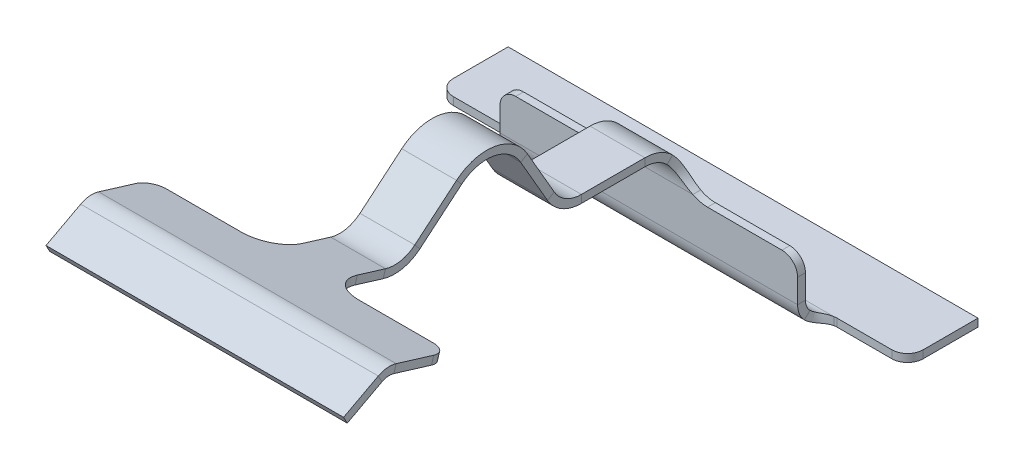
ISO-10303-21;
HEADER;
FILE_DESCRIPTION(('STEP AP214'),'2;1');
FILE_NAME('part.step','',(''),(''),'','','');
FILE_SCHEMA(('AUTOMOTIVE_DESIGN { 1 0 10303 214 1 1 1 1 }'));
ENDSEC;
DATA;
#1=APPLICATION_CONTEXT('core data for automotive mechanical design processes');
#2=APPLICATION_PROTOCOL_DEFINITION('international standard','automotive_design',2000,#1);
#3=PRODUCT_CONTEXT('',#1,'mechanical');
#4=PRODUCT('Part','Part','',(#3));
#5=PRODUCT_RELATED_PRODUCT_CATEGORY('part','',(#4));
#6=PRODUCT_DEFINITION_FORMATION('','',#4);
#7=PRODUCT_DEFINITION_CONTEXT('part definition',#1,'design');
#8=PRODUCT_DEFINITION('design','',#6,#7);
#9=PRODUCT_DEFINITION_SHAPE('','',#8);
#10=(LENGTH_UNIT() NAMED_UNIT(*) SI_UNIT(.MILLI.,.METRE.));
#11=(NAMED_UNIT(*) PLANE_ANGLE_UNIT() SI_UNIT($,.RADIAN.));
#12=(NAMED_UNIT(*) SI_UNIT($,.STERADIAN.) SOLID_ANGLE_UNIT());
#13=UNCERTAINTY_MEASURE_WITH_UNIT(LENGTH_MEASURE(1.E-05),#10,'distance_accuracy_value','');
#14=(GEOMETRIC_REPRESENTATION_CONTEXT(3) GLOBAL_UNCERTAINTY_ASSIGNED_CONTEXT((#13)) GLOBAL_UNIT_ASSIGNED_CONTEXT((#10,
#11,#12)) REPRESENTATION_CONTEXT('',''));
#15=CARTESIAN_POINT('',(0.,0.,0.));
#16=DIRECTION('',(0.,0.,1.));
#17=DIRECTION('',(1.,0.,0.));
#18=AXIS2_PLACEMENT_3D('',#15,#16,#17);
#19=CARTESIAN_POINT('',(-9.50000000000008,14.3076746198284,29.2516730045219));
#20=DIRECTION('',(0.,0.469471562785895,-0.882947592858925));
#21=DIRECTION('',(0.,0.882947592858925,0.469471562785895));
#22=AXIS2_PLACEMENT_3D('',#19,#20,#21);
#23=PLANE('',#22);
#24=DIRECTION('',(-1.,0.,0.));
#25=VECTOR('',#24,1.);
#26=CARTESIAN_POINT('',(-9.50000000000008,14.7491484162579,29.4864087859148));
#27=LINE('',#26,#25);
#28=CARTESIAN_POINT('',(9.49999999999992,14.7491484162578,29.4864087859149));
#29=VERTEX_POINT('',#28);
#30=CARTESIAN_POINT('',(-9.50000000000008,14.7491484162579,29.4864087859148));
#31=VERTEX_POINT('',#30);
#32=EDGE_CURVE('E462',#29,#31,#27,.T.);
#33=ORIENTED_EDGE('',*,*,#32,.T.);
#34=DIRECTION('',(0.,0.882947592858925,0.469471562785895));
#35=VECTOR('',#34,1.);
#36=CARTESIAN_POINT('',(-9.50000000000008,14.3076746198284,29.2516730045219));
#37=LINE('',#36,#35);
#38=CARTESIAN_POINT('',(-9.50000000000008,14.3076746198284,29.2516730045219));
#39=VERTEX_POINT('',#38);
#40=EDGE_CURVE('E454',#39,#31,#37,.T.);
#41=ORIENTED_EDGE('',*,*,#40,.F.);
#42=DIRECTION('',(-1.,0.,0.));
#43=VECTOR('',#42,1.);
#44=CARTESIAN_POINT('',(-9.50000000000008,14.3076746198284,29.2516730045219));
#45=LINE('',#44,#43);
#46=CARTESIAN_POINT('',(9.49999999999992,14.3076746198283,29.251673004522));
#47=VERTEX_POINT('',#46);
#48=EDGE_CURVE('E11',#47,#39,#45,.T.);
#49=ORIENTED_EDGE('',*,*,#48,.F.);
#50=DIRECTION('',(0.,0.882947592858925,0.469471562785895));
#51=VECTOR('',#50,1.);
#52=CARTESIAN_POINT('',(9.49999999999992,14.3076746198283,29.251673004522));
#53=LINE('',#52,#51);
#54=EDGE_CURVE('E459',#47,#29,#53,.T.);
#55=ORIENTED_EDGE('',*,*,#54,.T.);
#56=EDGE_LOOP('',(#33,#41,#49,#55));
#57=FACE_BOUND('',#56,.T.);
#58=ADVANCED_FACE('F24',(#57),#23,.F.);
#59=CARTESIAN_POINT('',(9.49999999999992,14.3076746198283,29.251673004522));
#60=DIRECTION('',(-1.,0.,0.));
#61=DIRECTION('',(0.,0.469471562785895,-0.882947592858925));
#62=AXIS2_PLACEMENT_3D('',#59,#60,#61);
#63=PLANE('',#62);
#64=DIRECTION('',(0.,-0.882947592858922,-0.469471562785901));
#65=VECTOR('',#64,1.);
#66=CARTESIAN_POINT('',(9.49999999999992,15.4856379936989,27.0362461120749));
#67=LINE('',#66,#65);
#68=CARTESIAN_POINT('',(9.49999999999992,15.9271117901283,27.2709818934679));
#69=VERTEX_POINT('',#68);
#70=CARTESIAN_POINT('',(9.49999999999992,15.4856379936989,27.0362461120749));
#71=VERTEX_POINT('',#70);
#72=EDGE_CURVE('E28',#69,#71,#67,.T.);
#73=ORIENTED_EDGE('',*,*,#72,.F.);
#74=DIRECTION('',(0.,-0.469471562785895,0.882947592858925));
#75=VECTOR('',#74,1.);
#76=CARTESIAN_POINT('',(9.49999999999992,14.7491484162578,29.4864087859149));
#77=LINE('',#76,#75);
#78=EDGE_CURVE('E457',#69,#29,#77,.T.);
#79=ORIENTED_EDGE('',*,*,#78,.T.);
#80=ORIENTED_EDGE('',*,*,#54,.F.);
#81=DIRECTION('',(0.,-0.469471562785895,0.882947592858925));
#82=VECTOR('',#81,1.);
#83=CARTESIAN_POINT('',(9.49999999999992,14.3076746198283,29.251673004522));
#84=LINE('',#83,#82);
#85=EDGE_CURVE('E34',#71,#47,#84,.T.);
#86=ORIENTED_EDGE('',*,*,#85,.F.);
#87=EDGE_LOOP('',(#73,#79,#80,#86));
#88=FACE_BOUND('',#87,.T.);
#89=ADVANCED_FACE('F1241',(#88),#63,.F.);
#90=CARTESIAN_POINT('',(-13.9999999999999,33.7627467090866,-6.27296872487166));
#91=DIRECTION('',(0.,-0.882947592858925,-0.469471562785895));
#92=DIRECTION('',(1.,0.,0.));
#93=AXIS2_PLACEMENT_3D('',#90,#91,#92);
#94=PLANE('',#93);
#95=DIRECTION('',(1.,0.,0.));
#96=VECTOR('',#95,1.);
#97=CARTESIAN_POINT('',(-14.0000000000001,15.9271117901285,27.2709818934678));
#98=LINE('',#97,#96);
#99=CARTESIAN_POINT('',(-9.50000000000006,15.9271117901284,27.2709818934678));
#100=VERTEX_POINT('',#99);
#101=EDGE_CURVE('E62',#100,#69,#98,.T.);
#102=ORIENTED_EDGE('',*,*,#101,.F.);
#103=DIRECTION('',(0.,0.469471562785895,-0.882947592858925));
#104=VECTOR('',#103,1.);
#105=CARTESIAN_POINT('',(-9.50000000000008,14.7491484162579,29.4864087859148));
#106=LINE('',#105,#104);
#107=EDGE_CURVE('E452',#31,#100,#106,.T.);
#108=ORIENTED_EDGE('',*,*,#107,.F.);
#109=ORIENTED_EDGE('',*,*,#32,.F.);
#110=ORIENTED_EDGE('',*,*,#78,.F.);
#111=EDGE_LOOP('',(#102,#108,#109,#110));
#112=FACE_BOUND('',#111,.T.);
#113=ADVANCED_FACE('F1247',(#112),#94,.F.);
#114=CARTESIAN_POINT('',(-9.50000000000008,14.3076746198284,29.2516730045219));
#115=DIRECTION('',(1.,0.,0.));
#116=DIRECTION('',(0.,-0.469471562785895,0.882947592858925));
#117=AXIS2_PLACEMENT_3D('',#114,#115,#116);
#118=PLANE('',#117);
#119=DIRECTION('',(0.,0.882947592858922,0.469471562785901));
#120=VECTOR('',#119,1.);
#121=CARTESIAN_POINT('',(-9.50000000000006,15.485637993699,27.0362461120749));
#122=LINE('',#121,#120);
#123=CARTESIAN_POINT('',(-9.50000000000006,15.485637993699,27.0362461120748));
#124=VERTEX_POINT('',#123);
#125=EDGE_CURVE('E464',#124,#100,#122,.T.);
#126=ORIENTED_EDGE('',*,*,#125,.F.);
#127=DIRECTION('',(0.,0.469471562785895,-0.882947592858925));
#128=VECTOR('',#127,1.);
#129=CARTESIAN_POINT('',(-9.50000000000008,14.3076746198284,29.2516730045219));
#130=LINE('',#129,#128);
#131=EDGE_CURVE('E450',#39,#124,#130,.T.);
#132=ORIENTED_EDGE('',*,*,#131,.F.);
#133=ORIENTED_EDGE('',*,*,#40,.T.);
#134=ORIENTED_EDGE('',*,*,#107,.T.);
#135=EDGE_LOOP('',(#126,#132,#133,#134));
#136=FACE_BOUND('',#135,.T.);
#137=ADVANCED_FACE('F1254',(#136),#118,.F.);
#138=CARTESIAN_POINT('',(-13.9999999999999,33.3212729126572,-6.5077045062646));
#139=DIRECTION('',(0.,-0.882947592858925,-0.469471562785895));
#140=DIRECTION('',(1.,0.,0.));
#141=AXIS2_PLACEMENT_3D('',#138,#139,#140);
#142=PLANE('',#141);
#143=ORIENTED_EDGE('',*,*,#131,.T.);
#144=DIRECTION('',(1.,0.,0.));
#145=VECTOR('',#144,1.);
#146=CARTESIAN_POINT('',(-14.0000000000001,15.485637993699,27.0362461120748));
#147=LINE('',#146,#145);
#148=EDGE_CURVE('E67',#124,#71,#147,.T.);
#149=ORIENTED_EDGE('',*,*,#148,.T.);
#150=ORIENTED_EDGE('',*,*,#85,.T.);
#151=ORIENTED_EDGE('',*,*,#48,.T.);
#152=EDGE_LOOP('',(#143,#149,#150,#151));
#153=FACE_BOUND('',#152,.T.);
#154=ADVANCED_FACE('F26',(#153),#142,.T.);
#155=CARTESIAN_POINT('',(9.49999999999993,16.5796278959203,29.6127421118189));
#156=DIRECTION('',(-1.,0.,0.));
#157=DIRECTION('',(0.,-0.292371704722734,-0.956304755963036));
#158=AXIS2_PLACEMENT_3D('',#155,#156,#157);
#159=PLANE('',#158);
#160=DIRECTION('',(0.,0.292371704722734,0.956304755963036));
#161=VECTOR('',#160,1.);
#162=CARTESIAN_POINT('',(9.49999999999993,17.0577802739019,29.4665562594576));
#163=LINE('',#162,#161);
#164=CARTESIAN_POINT('',(9.4999999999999,15.3035500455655,23.7287277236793));
#165=VERTEX_POINT('',#164);
#166=CARTESIAN_POINT('',(9.49999999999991,16.0371475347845,26.128216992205));
#167=VERTEX_POINT('',#166);
#168=EDGE_CURVE('E443',#165,#167,#163,.T.);
#169=ORIENTED_EDGE('',*,*,#168,.T.);
#170=DIRECTION('',(0.,-0.956304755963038,0.292371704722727));
#171=VECTOR('',#170,1.);
#172=CARTESIAN_POINT('',(9.49999999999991,15.558995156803,26.2744028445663));
#173=LINE('',#172,#171);
#174=CARTESIAN_POINT('',(9.49999999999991,15.558995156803,26.2744028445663));
#175=VERTEX_POINT('',#174);
#176=EDGE_CURVE('E445',#167,#175,#173,.T.);
#177=ORIENTED_EDGE('',*,*,#176,.T.);
#178=DIRECTION('',(0.,0.292371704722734,0.956304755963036));
#179=VECTOR('',#178,1.);
#180=CARTESIAN_POINT('',(9.49999999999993,16.5796278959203,29.6127421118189));
#181=LINE('',#180,#179);
#182=CARTESIAN_POINT('',(9.4999999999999,14.8253976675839,23.8749135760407));
#183=VERTEX_POINT('',#182);
#184=EDGE_CURVE('E425',#183,#175,#181,.T.);
#185=ORIENTED_EDGE('',*,*,#184,.F.);
#186=DIRECTION('',(0.,0.956304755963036,-0.292371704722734));
#187=VECTOR('',#186,1.);
#188=CARTESIAN_POINT('',(9.4999999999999,14.8253976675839,23.8749135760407));
#189=LINE('',#188,#187);
#190=EDGE_CURVE('E522',#183,#165,#189,.T.);
#191=ORIENTED_EDGE('',*,*,#190,.T.);
#192=EDGE_LOOP('',(#169,#177,#185,#191));
#193=FACE_BOUND('',#192,.T.);
#194=ADVANCED_FACE('F1260',(#193),#159,.F.);
#195=CARTESIAN_POINT('',(8.4999999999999,14.8253976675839,23.8749135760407));
#196=DIRECTION('',(0.,0.956304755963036,-0.292371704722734));
#197=DIRECTION('',(-1.,0.,0.));
#198=AXIS2_PLACEMENT_3D('',#195,#196,#197);
#199=CYLINDRICAL_SURFACE('',#198,1.);
#200=CARTESIAN_POINT('',(8.4999999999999,15.3035500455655,23.7287277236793));
#201=DIRECTION('',(0.,-0.956304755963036,0.292371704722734));
#202=DIRECTION('',(-1.,0.,0.));
#203=AXIS2_PLACEMENT_3D('',#200,#201,#202);
#204=CIRCLE('',#203,1.);
#205=CARTESIAN_POINT('',(8.4999999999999,15.0111783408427,22.7724229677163));
#206=VERTEX_POINT('',#205);
#207=EDGE_CURVE('E131',#206,#165,#204,.T.);
#208=ORIENTED_EDGE('',*,*,#207,.T.);
#209=ORIENTED_EDGE('',*,*,#190,.F.);
#210=CARTESIAN_POINT('',(8.4999999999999,14.8253976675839,23.8749135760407));
#211=DIRECTION('',(0.,-0.956304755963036,0.292371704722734));
#212=DIRECTION('',(-1.,0.,0.));
#213=AXIS2_PLACEMENT_3D('',#210,#211,#212);
#214=CIRCLE('',#213,1.);
#215=CARTESIAN_POINT('',(8.4999999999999,14.5330259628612,22.9186088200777));
#216=VERTEX_POINT('',#215);
#217=EDGE_CURVE('E479',#216,#183,#214,.T.);
#218=ORIENTED_EDGE('',*,*,#217,.F.);
#219=DIRECTION('',(0.,0.956304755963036,-0.292371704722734));
#220=VECTOR('',#219,1.);
#221=CARTESIAN_POINT('',(8.4999999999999,14.5330259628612,22.9186088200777));
#222=LINE('',#221,#220);
#223=EDGE_CURVE('E519',#216,#206,#222,.T.);
#224=ORIENTED_EDGE('',*,*,#223,.T.);
#225=EDGE_LOOP('',(#208,#209,#218,#224));
#226=FACE_BOUND('',#225,.T.);
#227=ADVANCED_FACE('F1319',(#226),#199,.T.);
#228=CARTESIAN_POINT('',(3.74999999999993,14.5330259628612,22.9186088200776));
#229=DIRECTION('',(0.,0.292371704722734,0.956304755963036));
#230=DIRECTION('',(0.,-0.956304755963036,0.292371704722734));
#231=AXIS2_PLACEMENT_3D('',#228,#229,#230);
#232=PLANE('',#231);
#233=DIRECTION('',(1.,0.,0.));
#234=VECTOR('',#233,1.);
#235=CARTESIAN_POINT('',(3.74999999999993,15.0111783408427,22.7724229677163));
#236=LINE('',#235,#234);
#237=CARTESIAN_POINT('',(3.74999999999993,15.0111783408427,22.7724229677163));
#238=VERTEX_POINT('',#237);
#239=EDGE_CURVE('E517',#238,#206,#236,.T.);
#240=ORIENTED_EDGE('',*,*,#239,.T.);
#241=ORIENTED_EDGE('',*,*,#223,.F.);
#242=DIRECTION('',(1.,0.,0.));
#243=VECTOR('',#242,1.);
#244=CARTESIAN_POINT('',(3.74999999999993,14.5330259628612,22.9186088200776));
#245=LINE('',#244,#243);
#246=CARTESIAN_POINT('',(3.74999999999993,14.5330259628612,22.9186088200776));
#247=VERTEX_POINT('',#246);
#248=EDGE_CURVE('E481',#247,#216,#245,.T.);
#249=ORIENTED_EDGE('',*,*,#248,.F.);
#250=DIRECTION('',(0.,0.956304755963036,-0.292371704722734));
#251=VECTOR('',#250,1.);
#252=CARTESIAN_POINT('',(3.74999999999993,14.5330259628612,22.9186088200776));
#253=LINE('',#252,#251);
#254=EDGE_CURVE('E514',#247,#238,#253,.T.);
#255=ORIENTED_EDGE('',*,*,#254,.T.);
#256=EDGE_LOOP('',(#240,#241,#249,#255));
#257=FACE_BOUND('',#256,.T.);
#258=ADVANCED_FACE('F1322',(#257),#232,.F.);
#259=CARTESIAN_POINT('',(3.74999999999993,13.9482825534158,21.0059993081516));
#260=DIRECTION('',(0.,0.956304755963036,-0.292371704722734));
#261=DIRECTION('',(-1.,0.,0.));
#262=AXIS2_PLACEMENT_3D('',#259,#260,#261);
#263=CYLINDRICAL_SURFACE('',#262,2.);
#264=CARTESIAN_POINT('',(3.74999999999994,14.4264349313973,20.8598134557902));
#265=DIRECTION('',(0.,0.956304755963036,-0.292371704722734));
#266=DIRECTION('',(-1.,0.,0.));
#267=AXIS2_PLACEMENT_3D('',#264,#265,#266);
#268=CIRCLE('',#267,2.);
#269=CARTESIAN_POINT('',(1.74999999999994,14.4264349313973,20.8598134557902));
#270=VERTEX_POINT('',#269);
#271=EDGE_CURVE('E512',#270,#238,#268,.T.);
#272=ORIENTED_EDGE('',*,*,#271,.T.);
#273=ORIENTED_EDGE('',*,*,#254,.F.);
#274=CARTESIAN_POINT('',(3.74999999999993,13.9482825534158,21.0059993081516));
#275=DIRECTION('',(0.,0.956304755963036,-0.292371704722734));
#276=DIRECTION('',(-1.,0.,0.));
#277=AXIS2_PLACEMENT_3D('',#274,#275,#276);
#278=CIRCLE('',#277,2.);
#279=CARTESIAN_POINT('',(1.74999999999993,13.9482825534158,21.0059993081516));
#280=VERTEX_POINT('',#279);
#281=EDGE_CURVE('E483',#280,#247,#278,.T.);
#282=ORIENTED_EDGE('',*,*,#281,.F.);
#283=DIRECTION('',(0.,0.956304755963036,-0.292371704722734));
#284=VECTOR('',#283,1.);
#285=CARTESIAN_POINT('',(1.74999999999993,13.9482825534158,21.0059993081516));
#286=LINE('',#285,#284);
#287=EDGE_CURVE('E510',#280,#270,#286,.T.);
#288=ORIENTED_EDGE('',*,*,#287,.T.);
#289=EDGE_LOOP('',(#272,#273,#282,#288));
#290=FACE_BOUND('',#289,.T.);
#291=ADVANCED_FACE('F1325',(#290),#263,.F.);
#292=CARTESIAN_POINT('',(-8.50000000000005,14.5330259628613,22.9186088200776));
#293=DIRECTION('',(0.,0.292371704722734,0.956304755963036));
#294=DIRECTION('',(0.,-0.956304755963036,0.292371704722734));
#295=AXIS2_PLACEMENT_3D('',#292,#293,#294);
#296=PLANE('',#295);
#297=DIRECTION('',(1.,0.,0.));
#298=VECTOR('',#297,1.);
#299=CARTESIAN_POINT('',(-8.50000000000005,15.0111783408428,22.7724229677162));
#300=LINE('',#299,#298);
#301=CARTESIAN_POINT('',(-8.50000000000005,15.0111783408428,22.7724229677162));
#302=VERTEX_POINT('',#301);
#303=CARTESIAN_POINT('',(-3.75000000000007,15.0111783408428,22.7724229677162));
#304=VERTEX_POINT('',#303);
#305=EDGE_CURVE('E508',#302,#304,#300,.T.);
#306=ORIENTED_EDGE('',*,*,#305,.T.);
#307=DIRECTION('',(0.,0.956304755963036,-0.292371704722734));
#308=VECTOR('',#307,1.);
#309=CARTESIAN_POINT('',(-3.75000000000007,14.5330259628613,22.9186088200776));
#310=LINE('',#309,#308);
#311=CARTESIAN_POINT('',(-3.75000000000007,14.5330259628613,22.9186088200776));
#312=VERTEX_POINT('',#311);
#313=EDGE_CURVE('E498',#312,#304,#310,.T.);
#314=ORIENTED_EDGE('',*,*,#313,.F.);
#315=DIRECTION('',(1.,0.,0.));
#316=VECTOR('',#315,1.);
#317=CARTESIAN_POINT('',(-8.50000000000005,14.5330259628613,22.9186088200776));
#318=LINE('',#317,#316);
#319=CARTESIAN_POINT('',(-8.50000000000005,14.5330259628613,22.9186088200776));
#320=VERTEX_POINT('',#319);
#321=EDGE_CURVE('E434',#320,#312,#318,.T.);
#322=ORIENTED_EDGE('',*,*,#321,.F.);
#323=DIRECTION('',(0.,0.956304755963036,-0.292371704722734));
#324=VECTOR('',#323,1.);
#325=CARTESIAN_POINT('',(-8.50000000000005,14.5330259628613,22.9186088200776));
#326=LINE('',#325,#324);
#327=EDGE_CURVE('E505',#320,#302,#326,.T.);
#328=ORIENTED_EDGE('',*,*,#327,.T.);
#329=EDGE_LOOP('',(#306,#314,#322,#328));
#330=FACE_BOUND('',#329,.T.);
#331=ADVANCED_FACE('F1329',(#330),#296,.F.);
#332=CARTESIAN_POINT('',(-8.50000000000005,14.825397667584,23.8749135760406));
#333=DIRECTION('',(0.,0.956304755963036,-0.292371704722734));
#334=DIRECTION('',(-1.,0.,0.));
#335=AXIS2_PLACEMENT_3D('',#332,#333,#334);
#336=CYLINDRICAL_SURFACE('',#335,1.);
#337=CARTESIAN_POINT('',(-8.50000000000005,15.3035500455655,23.7287277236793));
#338=DIRECTION('',(0.,-0.956304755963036,0.292371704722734));
#339=DIRECTION('',(-1.,0.,0.));
#340=AXIS2_PLACEMENT_3D('',#337,#338,#339);
#341=CIRCLE('',#340,1.);
#342=CARTESIAN_POINT('',(-9.50000000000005,15.3035500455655,23.7287277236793));
#343=VERTEX_POINT('',#342);
#344=EDGE_CURVE('E503',#343,#302,#341,.T.);
#345=ORIENTED_EDGE('',*,*,#344,.T.);
#346=ORIENTED_EDGE('',*,*,#327,.F.);
#347=CARTESIAN_POINT('',(-8.50000000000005,14.825397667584,23.8749135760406));
#348=DIRECTION('',(0.,-0.956304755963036,0.292371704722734));
#349=DIRECTION('',(-1.,0.,0.));
#350=AXIS2_PLACEMENT_3D('',#347,#348,#349);
#351=CIRCLE('',#350,1.);
#352=CARTESIAN_POINT('',(-9.50000000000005,14.825397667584,23.8749135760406));
#353=VERTEX_POINT('',#352);
#354=EDGE_CURVE('E431',#353,#320,#351,.T.);
#355=ORIENTED_EDGE('',*,*,#354,.F.);
#356=DIRECTION('',(0.,0.956304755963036,-0.292371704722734));
#357=VECTOR('',#356,1.);
#358=CARTESIAN_POINT('',(-9.50000000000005,14.825397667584,23.8749135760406));
#359=LINE('',#358,#357);
#360=EDGE_CURVE('E408',#353,#343,#359,.T.);
#361=ORIENTED_EDGE('',*,*,#360,.T.);
#362=EDGE_LOOP('',(#345,#346,#355,#361));
#363=FACE_BOUND('',#362,.T.);
#364=ADVANCED_FACE('F1333',(#363),#336,.T.);
#365=CARTESIAN_POINT('',(-9.50000000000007,16.5796278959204,29.6127421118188));
#366=DIRECTION('',(1.,0.,0.));
#367=DIRECTION('',(0.,0.292371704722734,0.956304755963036));
#368=AXIS2_PLACEMENT_3D('',#365,#366,#367);
#369=PLANE('',#368);
#370=DIRECTION('',(0.,-0.292371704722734,-0.956304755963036));
#371=VECTOR('',#370,1.);
#372=CARTESIAN_POINT('',(-9.50000000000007,16.5796278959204,29.6127421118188));
#373=LINE('',#372,#371);
#374=CARTESIAN_POINT('',(-9.50000000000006,15.5589951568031,26.2744028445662));
#375=VERTEX_POINT('',#374);
#376=EDGE_CURVE('E422',#375,#353,#373,.T.);
#377=ORIENTED_EDGE('',*,*,#376,.F.);
#378=DIRECTION('',(0.,0.956304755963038,-0.292371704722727));
#379=VECTOR('',#378,1.);
#380=CARTESIAN_POINT('',(-9.50000000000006,15.5589951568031,26.2744028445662));
#381=LINE('',#380,#379);
#382=CARTESIAN_POINT('',(-9.50000000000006,16.0371475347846,26.1282169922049));
#383=VERTEX_POINT('',#382);
#384=EDGE_CURVE('E397',#375,#383,#381,.T.);
#385=ORIENTED_EDGE('',*,*,#384,.T.);
#386=DIRECTION('',(0.,-0.292371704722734,-0.956304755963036));
#387=VECTOR('',#386,1.);
#388=CARTESIAN_POINT('',(-9.50000000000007,17.0577802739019,29.4665562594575));
#389=LINE('',#388,#387);
#390=EDGE_CURVE('E407',#383,#343,#389,.T.);
#391=ORIENTED_EDGE('',*,*,#390,.T.);
#392=ORIENTED_EDGE('',*,*,#360,.F.);
#393=EDGE_LOOP('',(#377,#385,#391,#392));
#394=FACE_BOUND('',#393,.T.);
#395=ADVANCED_FACE('F428',(#394),#369,.F.);
#396=CARTESIAN_POINT('',(-3.75000000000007,13.9482825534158,21.0059993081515));
#397=DIRECTION('',(0.,0.956304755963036,-0.292371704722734));
#398=DIRECTION('',(-1.,0.,0.));
#399=AXIS2_PLACEMENT_3D('',#396,#397,#398);
#400=CYLINDRICAL_SURFACE('',#399,2.);
#401=CARTESIAN_POINT('',(-3.75000000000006,14.4264349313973,20.8598134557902));
#402=DIRECTION('',(0.,0.956304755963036,-0.292371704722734));
#403=DIRECTION('',(-1.,0.,0.));
#404=AXIS2_PLACEMENT_3D('',#401,#402,#403);
#405=CIRCLE('',#404,2.);
#406=CARTESIAN_POINT('',(-1.75000000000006,14.4264349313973,20.8598134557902));
#407=VERTEX_POINT('',#406);
#408=EDGE_CURVE('E426',#304,#407,#405,.T.);
#409=ORIENTED_EDGE('',*,*,#408,.T.);
#410=DIRECTION('',(0.,0.956304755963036,-0.292371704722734));
#411=VECTOR('',#410,1.);
#412=CARTESIAN_POINT('',(-1.75000000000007,13.9482825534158,21.0059993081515));
#413=LINE('',#412,#411);
#414=CARTESIAN_POINT('',(-1.75000000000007,13.9482825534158,21.0059993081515));
#415=VERTEX_POINT('',#414);
#416=EDGE_CURVE('E437',#415,#407,#413,.T.);
#417=ORIENTED_EDGE('',*,*,#416,.F.);
#418=CARTESIAN_POINT('',(-3.75000000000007,13.9482825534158,21.0059993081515));
#419=DIRECTION('',(0.,0.956304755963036,-0.292371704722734));
#420=DIRECTION('',(-1.,0.,0.));
#421=AXIS2_PLACEMENT_3D('',#418,#419,#420);
#422=CIRCLE('',#421,2.);
#423=EDGE_CURVE('E493',#312,#415,#422,.T.);
#424=ORIENTED_EDGE('',*,*,#423,.F.);
#425=ORIENTED_EDGE('',*,*,#313,.T.);
#426=EDGE_LOOP('',(#409,#417,#424,#425));
#427=FACE_BOUND('',#426,.T.);
#428=ADVANCED_FACE('F1338',(#427),#400,.F.);
#429=CARTESIAN_POINT('',(-1.75,6.93136164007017,-1.94531483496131));
#430=DIRECTION('',(1.,0.,0.));
#431=DIRECTION('',(0.,0.292371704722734,0.956304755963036));
#432=AXIS2_PLACEMENT_3D('',#429,#430,#431);
#433=PLANE('',#432);
#434=DIRECTION('',(0.,0.956304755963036,-0.292371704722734));
#435=VECTOR('',#434,1.);
#436=CARTESIAN_POINT('',(-1.75000000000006,13.3983876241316,19.2073740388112));
#437=LINE('',#436,#435);
#438=CARTESIAN_POINT('',(-1.75000000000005,13.3983876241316,19.2073740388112));
#439=VERTEX_POINT('',#438);
#440=CARTESIAN_POINT('',(-1.75000000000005,13.8765400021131,19.0611881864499));
#441=VERTEX_POINT('',#440);
#442=EDGE_CURVE('E527',#439,#441,#437,.T.);
#443=ORIENTED_EDGE('',*,*,#442,.F.);
#444=DIRECTION('',(0.,-0.292371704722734,-0.956304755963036));
#445=VECTOR('',#444,1.);
#446=CARTESIAN_POINT('',(-1.75,6.93136164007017,-1.94531483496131));
#447=LINE('',#446,#445);
#448=EDGE_CURVE('E490',#415,#439,#447,.T.);
#449=ORIENTED_EDGE('',*,*,#448,.F.);
#450=ORIENTED_EDGE('',*,*,#416,.T.);
#451=DIRECTION('',(0.,-0.292371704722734,-0.956304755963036));
#452=VECTOR('',#451,1.);
#453=CARTESIAN_POINT('',(-1.74999999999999,7.40951401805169,-2.09150068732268));
#454=LINE('',#453,#452);
#455=EDGE_CURVE('E432',#407,#441,#454,.T.);
#456=ORIENTED_EDGE('',*,*,#455,.T.);
#457=EDGE_LOOP('',(#443,#449,#450,#456));
#458=FACE_BOUND('',#457,.T.);
#459=ADVANCED_FACE('F1341',(#458),#433,.F.);
#460=CARTESIAN_POINT('',(-14.,4.73857385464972,-9.11760050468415));
#461=DIRECTION('',(0.,-0.956304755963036,0.292371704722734));
#462=DIRECTION('',(1.,0.,0.));
#463=AXIS2_PLACEMENT_3D('',#460,#461,#462);
#464=PLANE('',#463);
#465=DIRECTION('',(1.,0.,0.));
#466=VECTOR('',#465,1.);
#467=CARTESIAN_POINT('',(-14.0000000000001,15.5589951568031,26.2744028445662));
#468=LINE('',#467,#466);
#469=EDGE_CURVE('E415',#375,#175,#468,.T.);
#470=ORIENTED_EDGE('',*,*,#469,.F.);
#471=ORIENTED_EDGE('',*,*,#376,.T.);
#472=ORIENTED_EDGE('',*,*,#354,.T.);
#473=ORIENTED_EDGE('',*,*,#321,.T.);
#474=ORIENTED_EDGE('',*,*,#423,.T.);
#475=ORIENTED_EDGE('',*,*,#448,.T.);
#476=DIRECTION('',(1.,0.,0.));
#477=VECTOR('',#476,1.);
#478=CARTESIAN_POINT('',(-14.0000000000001,13.3983876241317,19.2073740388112));
#479=LINE('',#478,#477);
#480=CARTESIAN_POINT('',(1.74999999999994,13.3983876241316,19.2073740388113));
#481=VERTEX_POINT('',#480);
#482=EDGE_CURVE('E487',#439,#481,#479,.T.);
#483=ORIENTED_EDGE('',*,*,#482,.T.);
#484=DIRECTION('',(0.,0.292371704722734,0.956304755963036));
#485=VECTOR('',#484,1.);
#486=CARTESIAN_POINT('',(1.75,6.93136164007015,-1.94531483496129));
#487=LINE('',#486,#485);
#488=EDGE_CURVE('E485',#481,#280,#487,.T.);
#489=ORIENTED_EDGE('',*,*,#488,.T.);
#490=ORIENTED_EDGE('',*,*,#281,.T.);
#491=ORIENTED_EDGE('',*,*,#248,.T.);
#492=ORIENTED_EDGE('',*,*,#217,.T.);
#493=ORIENTED_EDGE('',*,*,#184,.T.);
#494=EDGE_LOOP('',(#470,#471,#472,#473,#474,#475,#483,#489,#490,#491,#492,#493));
#495=FACE_BOUND('',#494,.T.);
#496=ADVANCED_FACE('F421',(#495),#464,.T.);
#497=CARTESIAN_POINT('',(1.75,6.93136164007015,-1.94531483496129));
#498=DIRECTION('',(-1.,0.,0.));
#499=DIRECTION('',(0.,-0.292371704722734,-0.956304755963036));
#500=AXIS2_PLACEMENT_3D('',#497,#498,#499);
#501=PLANE('',#500);
#502=DIRECTION('',(0.,-0.956304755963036,0.292371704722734));
#503=VECTOR('',#502,1.);
#504=CARTESIAN_POINT('',(1.74999999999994,13.3983876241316,19.2073740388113));
#505=LINE('',#504,#503);
#506=CARTESIAN_POINT('',(1.74999999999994,13.8765400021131,19.0611881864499));
#507=VERTEX_POINT('',#506);
#508=EDGE_CURVE('E446',#507,#481,#505,.T.);
#509=ORIENTED_EDGE('',*,*,#508,.F.);
#510=DIRECTION('',(0.,0.292371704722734,0.956304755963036));
#511=VECTOR('',#510,1.);
#512=CARTESIAN_POINT('',(1.75000000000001,7.40951401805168,-2.09150068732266));
#513=LINE('',#512,#511);
#514=EDGE_CURVE('E76',#507,#270,#513,.T.);
#515=ORIENTED_EDGE('',*,*,#514,.T.);
#516=ORIENTED_EDGE('',*,*,#287,.F.);
#517=ORIENTED_EDGE('',*,*,#488,.F.);
#518=EDGE_LOOP('',(#509,#515,#516,#517));
#519=FACE_BOUND('',#518,.T.);
#520=ADVANCED_FACE('F1346',(#519),#501,.F.);
#521=CARTESIAN_POINT('',(-14.,5.21672623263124,-9.26378635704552));
#522=DIRECTION('',(0.,-0.956304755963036,0.292371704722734));
#523=DIRECTION('',(1.,0.,0.));
#524=AXIS2_PLACEMENT_3D('',#521,#522,#523);
#525=PLANE('',#524);
#526=ORIENTED_EDGE('',*,*,#390,.F.);
#527=DIRECTION('',(1.,0.,0.));
#528=VECTOR('',#527,1.);
#529=CARTESIAN_POINT('',(-14.0000000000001,16.0371475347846,26.1282169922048));
#530=LINE('',#529,#528);
#531=EDGE_CURVE('E466',#383,#167,#530,.T.);
#532=ORIENTED_EDGE('',*,*,#531,.T.);
#533=ORIENTED_EDGE('',*,*,#168,.F.);
#534=ORIENTED_EDGE('',*,*,#207,.F.);
#535=ORIENTED_EDGE('',*,*,#239,.F.);
#536=ORIENTED_EDGE('',*,*,#271,.F.);
#537=ORIENTED_EDGE('',*,*,#514,.F.);
#538=DIRECTION('',(1.,0.,0.));
#539=VECTOR('',#538,1.);
#540=CARTESIAN_POINT('',(-14.0000000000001,13.8765400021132,19.0611881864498));
#541=LINE('',#540,#539);
#542=EDGE_CURVE('E526',#441,#507,#541,.T.);
#543=ORIENTED_EDGE('',*,*,#542,.F.);
#544=ORIENTED_EDGE('',*,*,#455,.F.);
#545=ORIENTED_EDGE('',*,*,#408,.F.);
#546=ORIENTED_EDGE('',*,*,#305,.F.);
#547=ORIENTED_EDGE('',*,*,#344,.F.);
#548=EDGE_LOOP('',(#526,#532,#533,#534,#535,#536,#537,#543,#544,#545,#546,#547));
#549=FACE_BOUND('',#548,.T.);
#550=ADVANCED_FACE('F1317',(#549),#525,.F.);
#551=CARTESIAN_POINT('',(1.75000000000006,26.6531752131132,1.63989355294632));
#552=DIRECTION('',(-1.,0.,0.));
#553=DIRECTION('',(0.,0.642787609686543,-0.766044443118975));
#554=AXIS2_PLACEMENT_3D('',#551,#552,#553);
#555=PLANE('',#554);
#556=DIRECTION('',(0.,-0.642787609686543,0.766044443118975));
#557=VECTOR('',#556,1.);
#558=CARTESIAN_POINT('',(1.75000000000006,27.0361974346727,1.96128735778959));
#559=LINE('',#558,#557);
#560=CARTESIAN_POINT('',(1.74999999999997,16.4945913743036,14.5242842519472));
#561=VERTEX_POINT('',#560);
#562=CARTESIAN_POINT('',(1.74999999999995,14.2570606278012,17.1908695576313));
#563=VERTEX_POINT('',#562);
#564=EDGE_CURVE('E537',#561,#563,#559,.T.);
#565=ORIENTED_EDGE('',*,*,#564,.T.);
#566=DIRECTION('',(0.,-0.766044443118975,-0.642787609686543));
#567=VECTOR('',#566,1.);
#568=CARTESIAN_POINT('',(1.74999999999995,13.8740384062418,16.8694757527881));
#569=LINE('',#568,#567);
#570=CARTESIAN_POINT('',(1.74999999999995,13.8740384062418,16.8694757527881));
#571=VERTEX_POINT('',#570);
#572=EDGE_CURVE('E547',#563,#571,#569,.T.);
#573=ORIENTED_EDGE('',*,*,#572,.T.);
#574=DIRECTION('',(0.,-0.642787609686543,0.766044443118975));
#575=VECTOR('',#574,1.);
#576=CARTESIAN_POINT('',(1.75000000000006,26.6531752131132,1.63989355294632));
#577=LINE('',#576,#575);
#578=CARTESIAN_POINT('',(1.74999999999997,16.1115691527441,14.2028904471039));
#579=VERTEX_POINT('',#578);
#580=EDGE_CURVE('E528',#579,#571,#577,.T.);
#581=ORIENTED_EDGE('',*,*,#580,.F.);
#582=DIRECTION('',(0.,-0.76604444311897,-0.642787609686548));
#583=VECTOR('',#582,1.);
#584=CARTESIAN_POINT('',(1.74999999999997,16.111569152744,14.2028904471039));
#585=LINE('',#584,#583);
#586=EDGE_CURVE('E560',#561,#579,#585,.T.);
#587=ORIENTED_EDGE('',*,*,#586,.F.);
#588=EDGE_LOOP('',(#565,#573,#581,#587));
#589=FACE_BOUND('',#588,.T.);
#590=ADVANCED_FACE('F1311',(#589),#555,.F.);
#591=CARTESIAN_POINT('',(-13.9999999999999,31.8571045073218,-3.7840459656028));
#592=DIRECTION('',(0.,-0.766044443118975,-0.642787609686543));
#593=DIRECTION('',(1.,0.,0.));
#594=AXIS2_PLACEMENT_3D('',#591,#592,#593);
#595=PLANE('',#594);
#596=DIRECTION('',(0.,0.642787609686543,-0.766044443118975));
#597=VECTOR('',#596,1.);
#598=CARTESIAN_POINT('',(-1.74999999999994,27.0361974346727,1.96128735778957));
#599=LINE('',#598,#597);
#600=CARTESIAN_POINT('',(-1.75000000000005,14.2570606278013,17.1908695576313));
#601=VERTEX_POINT('',#600);
#602=CARTESIAN_POINT('',(-1.75000000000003,16.4945913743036,14.5242842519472));
#603=VERTEX_POINT('',#602);
#604=EDGE_CURVE('E476',#601,#603,#599,.T.);
#605=ORIENTED_EDGE('',*,*,#604,.F.);
#606=DIRECTION('',(1.,0.,0.));
#607=VECTOR('',#606,1.);
#608=CARTESIAN_POINT('',(-14.,14.2570606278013,17.1908695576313));
#609=LINE('',#608,#607);
#610=EDGE_CURVE('E544',#601,#563,#609,.T.);
#611=ORIENTED_EDGE('',*,*,#610,.T.);
#612=ORIENTED_EDGE('',*,*,#564,.F.);
#613=DIRECTION('',(1.,0.,0.));
#614=VECTOR('',#613,1.);
#615=CARTESIAN_POINT('',(-14.,16.4945913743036,14.5242842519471));
#616=LINE('',#615,#614);
#617=EDGE_CURVE('E555',#603,#561,#616,.T.);
#618=ORIENTED_EDGE('',*,*,#617,.F.);
#619=EDGE_LOOP('',(#605,#611,#612,#618));
#620=FACE_BOUND('',#619,.T.);
#621=ADVANCED_FACE('F1304',(#620),#595,.F.);
#622=CARTESIAN_POINT('',(-1.74999999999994,26.6531752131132,1.6398935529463));
#623=DIRECTION('',(1.,0.,0.));
#624=DIRECTION('',(0.,-0.642787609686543,0.766044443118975));
#625=AXIS2_PLACEMENT_3D('',#622,#623,#624);
#626=PLANE('',#625);
#627=DIRECTION('',(0.,0.642787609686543,-0.766044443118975));
#628=VECTOR('',#627,1.);
#629=CARTESIAN_POINT('',(-1.74999999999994,26.6531752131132,1.6398935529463));
#630=LINE('',#629,#628);
#631=CARTESIAN_POINT('',(-1.75000000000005,13.8740384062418,16.869475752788));
#632=VERTEX_POINT('',#631);
#633=CARTESIAN_POINT('',(-1.75000000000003,16.1115691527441,14.2028904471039));
#634=VERTEX_POINT('',#633);
#635=EDGE_CURVE('E148',#632,#634,#630,.T.);
#636=ORIENTED_EDGE('',*,*,#635,.F.);
#637=DIRECTION('',(0.,0.766044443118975,0.642787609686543));
#638=VECTOR('',#637,1.);
#639=CARTESIAN_POINT('',(-1.75000000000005,13.8740384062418,16.8694757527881));
#640=LINE('',#639,#638);
#641=EDGE_CURVE('E539',#632,#601,#640,.T.);
#642=ORIENTED_EDGE('',*,*,#641,.T.);
#643=ORIENTED_EDGE('',*,*,#604,.T.);
#644=DIRECTION('',(0.,0.76604444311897,0.642787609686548));
#645=VECTOR('',#644,1.);
#646=CARTESIAN_POINT('',(-1.75000000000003,16.111569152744,14.2028904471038));
#647=LINE('',#646,#645);
#648=EDGE_CURVE('E558',#634,#603,#647,.T.);
#649=ORIENTED_EDGE('',*,*,#648,.F.);
#650=EDGE_LOOP('',(#636,#642,#643,#649));
#651=FACE_BOUND('',#650,.T.);
#652=ADVANCED_FACE('F1301',(#651),#626,.F.);
#653=CARTESIAN_POINT('',(-13.9999999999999,31.4740822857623,-4.10543977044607));
#654=DIRECTION('',(0.,-0.766044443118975,-0.642787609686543));
#655=DIRECTION('',(1.,0.,0.));
#656=AXIS2_PLACEMENT_3D('',#653,#654,#655);
#657=PLANE('',#656);
#658=DIRECTION('',(1.,0.,0.));
#659=VECTOR('',#658,1.);
#660=CARTESIAN_POINT('',(-14.,13.8740384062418,16.869475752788));
#661=LINE('',#660,#659);
#662=EDGE_CURVE('E553',#632,#571,#661,.T.);
#663=ORIENTED_EDGE('',*,*,#662,.F.);
#664=ORIENTED_EDGE('',*,*,#635,.T.);
#665=DIRECTION('',(1.,0.,0.));
#666=VECTOR('',#665,1.);
#667=CARTESIAN_POINT('',(-14.,16.1115691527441,14.2028904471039));
#668=LINE('',#667,#666);
#669=EDGE_CURVE('E165',#634,#579,#668,.T.);
#670=ORIENTED_EDGE('',*,*,#669,.T.);
#671=ORIENTED_EDGE('',*,*,#580,.T.);
#672=EDGE_LOOP('',(#663,#664,#670,#671));
#673=FACE_BOUND('',#672,.T.);
#674=ADVANCED_FACE('F1303',(#673),#657,.T.);
#675=CARTESIAN_POINT('',(-14.,-0.844776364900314,0.447759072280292));
#676=DIRECTION('',(0.,-0.500000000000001,0.866025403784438));
#677=DIRECTION('',(1.,0.,0.));
#678=AXIS2_PLACEMENT_3D('',#675,#676,#677);
#679=PLANE('',#678);
#680=DIRECTION('',(0.,-0.866025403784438,-0.500000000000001));
#681=VECTOR('',#680,1.);
#682=CARTESIAN_POINT('',(-1.75000000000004,5.65041416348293,4.19775907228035));
#683=LINE('',#682,#681);
#684=CARTESIAN_POINT('',(-1.75000000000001,15.6964580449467,9.99784521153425));
#685=VERTEX_POINT('',#684);
#686=CARTESIAN_POINT('',(-1.75000000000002,12.7328541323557,8.28680769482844));
#687=VERTEX_POINT('',#686);
#688=EDGE_CURVE('E579',#685,#687,#683,.T.);
#689=ORIENTED_EDGE('',*,*,#688,.F.);
#690=DIRECTION('',(1.,0.,0.));
#691=VECTOR('',#690,1.);
#692=CARTESIAN_POINT('',(-14.,15.6964580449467,9.99784521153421));
#693=LINE('',#692,#691);
#694=CARTESIAN_POINT('',(1.74999999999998,15.6964580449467,9.99784521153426));
#695=VERTEX_POINT('',#694);
#696=EDGE_CURVE('E564',#685,#695,#693,.T.);
#697=ORIENTED_EDGE('',*,*,#696,.T.);
#698=DIRECTION('',(0.,0.866025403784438,0.500000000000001));
#699=VECTOR('',#698,1.);
#700=CARTESIAN_POINT('',(1.74999999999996,5.65041416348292,4.19775907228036));
#701=LINE('',#700,#699);
#702=CARTESIAN_POINT('',(1.74999999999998,12.7328541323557,8.28680769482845));
#703=VERTEX_POINT('',#702);
#704=EDGE_CURVE('E584',#703,#695,#701,.T.);
#705=ORIENTED_EDGE('',*,*,#704,.F.);
#706=DIRECTION('',(1.,0.,0.));
#707=VECTOR('',#706,1.);
#708=CARTESIAN_POINT('',(-14.,12.7328541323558,8.28680769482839));
#709=LINE('',#708,#707);
#710=EDGE_CURVE('E843',#687,#703,#709,.T.);
#711=ORIENTED_EDGE('',*,*,#710,.F.);
#712=EDGE_LOOP('',(#689,#697,#705,#711));
#713=FACE_BOUND('',#712,.T.);
#714=ADVANCED_FACE('F1294',(#713),#679,.F.);
#715=CARTESIAN_POINT('',(1.74999999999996,5.40041416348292,4.63077177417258));
#716=DIRECTION('',(-1.,0.,0.));
#717=DIRECTION('',(0.,-0.866025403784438,-0.500000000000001));
#718=AXIS2_PLACEMENT_3D('',#715,#716,#717);
#719=PLANE('',#718);
#720=ORIENTED_EDGE('',*,*,#704,.T.);
#721=DIRECTION('',(0.,-0.500000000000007,0.866025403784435));
#722=VECTOR('',#721,1.);
#723=CARTESIAN_POINT('',(1.74999999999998,15.4464580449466,10.4308579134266));
#724=LINE('',#723,#722);
#725=CARTESIAN_POINT('',(1.74999999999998,15.4464580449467,10.4308579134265));
#726=VERTEX_POINT('',#725);
#727=EDGE_CURVE('E571',#695,#726,#724,.T.);
#728=ORIENTED_EDGE('',*,*,#727,.T.);
#729=DIRECTION('',(0.,0.866025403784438,0.500000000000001));
#730=VECTOR('',#729,1.);
#731=CARTESIAN_POINT('',(1.74999999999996,5.40041416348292,4.63077177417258));
#732=LINE('',#731,#730);
#733=CARTESIAN_POINT('',(1.74999999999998,12.4828541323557,8.71982039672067));
#734=VERTEX_POINT('',#733);
#735=EDGE_CURVE('E575',#734,#726,#732,.T.);
#736=ORIENTED_EDGE('',*,*,#735,.F.);
#737=DIRECTION('',(0.,-0.500000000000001,0.866025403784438));
#738=VECTOR('',#737,1.);
#739=CARTESIAN_POINT('',(1.74999999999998,12.4828541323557,8.71982039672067));
#740=LINE('',#739,#738);
#741=EDGE_CURVE('E845',#703,#734,#740,.T.);
#742=ORIENTED_EDGE('',*,*,#741,.F.);
#743=EDGE_LOOP('',(#720,#728,#736,#742));
#744=FACE_BOUND('',#743,.T.);
#745=ADVANCED_FACE('F852',(#744),#719,.F.);
#746=CARTESIAN_POINT('',(-1.75000000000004,5.40041416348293,4.63077177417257));
#747=DIRECTION('',(1.,0.,0.));
#748=DIRECTION('',(0.,0.866025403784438,0.500000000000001));
#749=AXIS2_PLACEMENT_3D('',#746,#747,#748);
#750=PLANE('',#749);
#751=DIRECTION('',(0.,-0.866025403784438,-0.500000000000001));
#752=VECTOR('',#751,1.);
#753=CARTESIAN_POINT('',(-1.75000000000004,5.40041416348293,4.63077177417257));
#754=LINE('',#753,#752);
#755=CARTESIAN_POINT('',(-1.75000000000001,15.4464580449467,10.4308579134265));
#756=VERTEX_POINT('',#755);
#757=CARTESIAN_POINT('',(-1.75000000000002,12.4828541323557,8.71982039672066));
#758=VERTEX_POINT('',#757);
#759=EDGE_CURVE('E578',#756,#758,#754,.T.);
#760=ORIENTED_EDGE('',*,*,#759,.F.);
#761=DIRECTION('',(0.,0.500000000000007,-0.866025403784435));
#762=VECTOR('',#761,1.);
#763=CARTESIAN_POINT('',(-1.75000000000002,15.4464580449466,10.4308579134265));
#764=LINE('',#763,#762);
#765=EDGE_CURVE('E849',#756,#685,#764,.T.);
#766=ORIENTED_EDGE('',*,*,#765,.T.);
#767=ORIENTED_EDGE('',*,*,#688,.T.);
#768=DIRECTION('',(0.,0.500000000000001,-0.866025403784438));
#769=VECTOR('',#768,1.);
#770=CARTESIAN_POINT('',(-1.75000000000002,12.4828541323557,8.71982039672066));
#771=LINE('',#770,#769);
#772=EDGE_CURVE('E847',#758,#687,#771,.T.);
#773=ORIENTED_EDGE('',*,*,#772,.F.);
#774=EDGE_LOOP('',(#760,#766,#767,#773));
#775=FACE_BOUND('',#774,.T.);
#776=ADVANCED_FACE('F1292',(#775),#750,.F.);
#777=CARTESIAN_POINT('',(-14.0000000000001,-1.09477636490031,0.88077177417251));
#778=DIRECTION('',(0.,-0.500000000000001,0.866025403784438));
#779=DIRECTION('',(1.,0.,0.));
#780=AXIS2_PLACEMENT_3D('',#777,#778,#779);
#781=PLANE('',#780);
#782=DIRECTION('',(1.,0.,0.));
#783=VECTOR('',#782,1.);
#784=CARTESIAN_POINT('',(-14.,15.4464580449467,10.4308579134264));
#785=LINE('',#784,#783);
#786=EDGE_CURVE('E561',#756,#726,#785,.T.);
#787=ORIENTED_EDGE('',*,*,#786,.F.);
#788=ORIENTED_EDGE('',*,*,#759,.T.);
#789=DIRECTION('',(1.,0.,0.));
#790=VECTOR('',#789,1.);
#791=CARTESIAN_POINT('',(-14.,12.4828541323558,8.71982039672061));
#792=LINE('',#791,#790);
#793=EDGE_CURVE('E582',#758,#734,#792,.T.);
#794=ORIENTED_EDGE('',*,*,#793,.T.);
#795=ORIENTED_EDGE('',*,*,#735,.T.);
#796=EDGE_LOOP('',(#787,#788,#794,#795));
#797=FACE_BOUND('',#796,.T.);
#798=ADVANCED_FACE('F855',(#797),#781,.T.);
#799=CARTESIAN_POINT('',(-10.5,4.98174770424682,-0.0182522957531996));
#800=DIRECTION('',(0.,1.,0.));
#801=DIRECTION('',(-1.,0.,0.));
#802=AXIS2_PLACEMENT_3D('',#799,#800,#801);
#803=CYLINDRICAL_SURFACE('',#802,1.);
#804=CARTESIAN_POINT('',(-10.3098120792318,5.48174770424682,-1.));
#805=CARTESIAN_POINT('',(-10.3098120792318,4.98174770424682,-1.));
#806=B_SPLINE_CURVE_WITH_KNOTS('',1,(#804,#805),.UNSPECIFIED.,.F.,.F.,(2,2),(0.,1.),.UNSPECIFIED.);
#807=CARTESIAN_POINT('',(-10.3098120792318,5.48174770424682,-1.));
#808=VERTEX_POINT('',#807);
#809=CARTESIAN_POINT('',(-10.3098120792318,4.98174770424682,-1.));
#810=VERTEX_POINT('',#809);
#811=EDGE_CURVE('E879',#808,#810,#806,.T.);
#812=ORIENTED_EDGE('',*,*,#811,.F.);
#813=CARTESIAN_POINT('',(-10.5,5.48174770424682,-0.0182522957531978));
#814=DIRECTION('',(0.,1.,0.));
#815=DIRECTION('',(-1.,0.,0.));
#816=AXIS2_PLACEMENT_3D('',#813,#814,#815);
#817=CIRCLE('',#816,1.);
#818=CARTESIAN_POINT('',(-10.5,5.48174770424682,-1.0182522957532));
#819=VERTEX_POINT('',#818);
#820=EDGE_CURVE('E835',#808,#819,#817,.T.);
#821=ORIENTED_EDGE('',*,*,#820,.T.);
#822=DIRECTION('',(0.,1.,0.));
#823=VECTOR('',#822,1.);
#824=CARTESIAN_POINT('',(-10.5,4.98174770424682,-1.0182522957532));
#825=LINE('',#824,#823);
#826=CARTESIAN_POINT('',(-10.5,4.98174770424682,-1.0182522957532));
#827=VERTEX_POINT('',#826);
#828=EDGE_CURVE('E830',#827,#819,#825,.T.);
#829=ORIENTED_EDGE('',*,*,#828,.F.);
#830=CARTESIAN_POINT('',(-10.5,4.98174770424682,-0.0182522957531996));
#831=DIRECTION('',(0.,1.,0.));
#832=DIRECTION('',(-1.,0.,0.));
#833=AXIS2_PLACEMENT_3D('',#830,#831,#832);
#834=CIRCLE('',#833,1.);
#835=EDGE_CURVE('E777',#810,#827,#834,.T.);
#836=ORIENTED_EDGE('',*,*,#835,.F.);
#837=EDGE_LOOP('',(#812,#821,#829,#836));
#838=FACE_BOUND('',#837,.T.);
#839=ADVANCED_FACE('F887',(#838),#803,.F.);
#840=CARTESIAN_POINT('',(-14.,4.98174770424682,-1.0182522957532));
#841=DIRECTION('',(0.,0.,-1.));
#842=DIRECTION('',(0.,1.,0.));
#843=AXIS2_PLACEMENT_3D('',#840,#841,#842);
#844=PLANE('',#843);
#845=DIRECTION('',(-1.,0.,0.));
#846=VECTOR('',#845,1.);
#847=CARTESIAN_POINT('',(-14.,5.48174770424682,-1.0182522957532));
#848=LINE('',#847,#846);
#849=CARTESIAN_POINT('',(-14.,5.48174770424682,-1.0182522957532));
#850=VERTEX_POINT('',#849);
#851=EDGE_CURVE('E833',#819,#850,#848,.T.);
#852=ORIENTED_EDGE('',*,*,#851,.T.);
#853=DIRECTION('',(0.,1.,0.));
#854=VECTOR('',#853,1.);
#855=CARTESIAN_POINT('',(-14.,4.98174770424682,-1.0182522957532));
#856=LINE('',#855,#854);
#857=CARTESIAN_POINT('',(-14.,4.98174770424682,-1.0182522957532));
#858=VERTEX_POINT('',#857);
#859=EDGE_CURVE('E825',#858,#850,#856,.T.);
#860=ORIENTED_EDGE('',*,*,#859,.F.);
#861=DIRECTION('',(-1.,0.,0.));
#862=VECTOR('',#861,1.);
#863=CARTESIAN_POINT('',(-14.,4.98174770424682,-1.0182522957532));
#864=LINE('',#863,#862);
#865=EDGE_CURVE('E775',#827,#858,#864,.T.);
#866=ORIENTED_EDGE('',*,*,#865,.F.);
#867=ORIENTED_EDGE('',*,*,#828,.T.);
#868=EDGE_LOOP('',(#852,#860,#866,#867));
#869=FACE_BOUND('',#868,.T.);
#870=ADVANCED_FACE('F897',(#869),#844,.F.);
#871=CARTESIAN_POINT('',(-14.,4.98174770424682,-2.0182522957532));
#872=DIRECTION('',(0.,1.,0.));
#873=DIRECTION('',(-1.,0.,0.));
#874=AXIS2_PLACEMENT_3D('',#871,#872,#873);
#875=CYLINDRICAL_SURFACE('',#874,1.);
#876=CARTESIAN_POINT('',(-14.,5.48174770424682,-2.0182522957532));
#877=DIRECTION('',(0.,-1.,0.));
#878=DIRECTION('',(1.,0.,0.));
#879=AXIS2_PLACEMENT_3D('',#876,#877,#878);
#880=CIRCLE('',#879,1.);
#881=CARTESIAN_POINT('',(-15.,5.48174770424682,-2.0182522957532));
#882=VERTEX_POINT('',#881);
#883=EDGE_CURVE('E828',#850,#882,#880,.T.);
#884=ORIENTED_EDGE('',*,*,#883,.T.);
#885=DIRECTION('',(0.,1.,0.));
#886=VECTOR('',#885,1.);
#887=CARTESIAN_POINT('',(-15.,4.98174770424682,-2.01825229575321));
#888=LINE('',#887,#886);
#889=CARTESIAN_POINT('',(-15.,4.98174770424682,-2.01825229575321));
#890=VERTEX_POINT('',#889);
#891=EDGE_CURVE('E819',#890,#882,#888,.T.);
#892=ORIENTED_EDGE('',*,*,#891,.F.);
#893=CARTESIAN_POINT('',(-14.,4.98174770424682,-2.0182522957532));
#894=DIRECTION('',(0.,-1.,0.));
#895=DIRECTION('',(1.,0.,0.));
#896=AXIS2_PLACEMENT_3D('',#893,#894,#895);
#897=CIRCLE('',#896,1.);
#898=EDGE_CURVE('E773',#858,#890,#897,.T.);
#899=ORIENTED_EDGE('',*,*,#898,.F.);
#900=ORIENTED_EDGE('',*,*,#859,.T.);
#901=EDGE_LOOP('',(#884,#892,#899,#900));
#902=FACE_BOUND('',#901,.T.);
#903=ADVANCED_FACE('F902',(#902),#875,.T.);
#904=CARTESIAN_POINT('',(-15.,4.98174770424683,-5.5182522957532));
#905=DIRECTION('',(1.,0.,0.));
#906=DIRECTION('',(0.,1.,0.));
#907=AXIS2_PLACEMENT_3D('',#904,#905,#906);
#908=PLANE('',#907);
#909=DIRECTION('',(0.,0.,-1.));
#910=VECTOR('',#909,1.);
#911=CARTESIAN_POINT('',(-15.,5.48174770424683,-5.5182522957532));
#912=LINE('',#911,#910);
#913=CARTESIAN_POINT('',(-15.,5.48174770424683,-5.5182522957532));
#914=VERTEX_POINT('',#913);
#915=EDGE_CURVE('E822',#882,#914,#912,.T.);
#916=ORIENTED_EDGE('',*,*,#915,.T.);
#917=DIRECTION('',(0.,1.,0.));
#918=VECTOR('',#917,1.);
#919=CARTESIAN_POINT('',(-15.,4.98174770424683,-5.5182522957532));
#920=LINE('',#919,#918);
#921=CARTESIAN_POINT('',(-15.,4.98174770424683,-5.5182522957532));
#922=VERTEX_POINT('',#921);
#923=EDGE_CURVE('E814',#922,#914,#920,.T.);
#924=ORIENTED_EDGE('',*,*,#923,.F.);
#925=DIRECTION('',(0.,0.,-1.));
#926=VECTOR('',#925,1.);
#927=CARTESIAN_POINT('',(-15.,4.98174770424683,-5.5182522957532));
#928=LINE('',#927,#926);
#929=EDGE_CURVE('E770',#890,#922,#928,.T.);
#930=ORIENTED_EDGE('',*,*,#929,.F.);
#931=ORIENTED_EDGE('',*,*,#891,.T.);
#932=EDGE_LOOP('',(#916,#924,#930,#931));
#933=FACE_BOUND('',#932,.T.);
#934=ADVANCED_FACE('F906',(#933),#908,.F.);
#935=CARTESIAN_POINT('',(-15.,4.98174770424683,-5.5182522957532));
#936=DIRECTION('',(0.,0.,1.));
#937=DIRECTION('',(0.,-1.,0.));
#938=AXIS2_PLACEMENT_3D('',#935,#936,#937);
#939=PLANE('',#938);
#940=DIRECTION('',(1.,0.,0.));
#941=VECTOR('',#940,1.);
#942=CARTESIAN_POINT('',(-15.,5.48174770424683,-5.5182522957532));
#943=LINE('',#942,#941);
#944=CARTESIAN_POINT('',(15.,5.48174770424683,-5.5182522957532));
#945=VERTEX_POINT('',#944);
#946=EDGE_CURVE('E817',#914,#945,#943,.T.);
#947=ORIENTED_EDGE('',*,*,#946,.T.);
#948=DIRECTION('',(0.,1.,0.));
#949=VECTOR('',#948,1.);
#950=CARTESIAN_POINT('',(15.,4.98174770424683,-5.5182522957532));
#951=LINE('',#950,#949);
#952=CARTESIAN_POINT('',(15.,4.98174770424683,-5.5182522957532));
#953=VERTEX_POINT('',#952);
#954=EDGE_CURVE('E809',#953,#945,#951,.T.);
#955=ORIENTED_EDGE('',*,*,#954,.F.);
#956=DIRECTION('',(1.,0.,0.));
#957=VECTOR('',#956,1.);
#958=CARTESIAN_POINT('',(-15.,4.98174770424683,-5.5182522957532));
#959=LINE('',#958,#957);
#960=EDGE_CURVE('E768',#922,#953,#959,.T.);
#961=ORIENTED_EDGE('',*,*,#960,.F.);
#962=ORIENTED_EDGE('',*,*,#923,.T.);
#963=EDGE_LOOP('',(#947,#955,#961,#962));
#964=FACE_BOUND('',#963,.T.);
#965=ADVANCED_FACE('F910',(#964),#939,.F.);
#966=CARTESIAN_POINT('',(15.,4.98174770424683,-5.5182522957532));
#967=DIRECTION('',(-1.,0.,0.));
#968=DIRECTION('',(0.,-1.,0.));
#969=AXIS2_PLACEMENT_3D('',#966,#967,#968);
#970=PLANE('',#969);
#971=DIRECTION('',(0.,0.,1.));
#972=VECTOR('',#971,1.);
#973=CARTESIAN_POINT('',(15.,5.48174770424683,-5.5182522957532));
#974=LINE('',#973,#972);
#975=CARTESIAN_POINT('',(15.,5.48174770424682,-2.0182522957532));
#976=VERTEX_POINT('',#975);
#977=EDGE_CURVE('E812',#945,#976,#974,.T.);
#978=ORIENTED_EDGE('',*,*,#977,.T.);
#979=DIRECTION('',(0.,1.,0.));
#980=VECTOR('',#979,1.);
#981=CARTESIAN_POINT('',(15.,4.98174770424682,-2.01825229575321));
#982=LINE('',#981,#980);
#983=CARTESIAN_POINT('',(15.,4.98174770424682,-2.01825229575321));
#984=VERTEX_POINT('',#983);
#985=EDGE_CURVE('E804',#984,#976,#982,.T.);
#986=ORIENTED_EDGE('',*,*,#985,.F.);
#987=DIRECTION('',(0.,0.,1.));
#988=VECTOR('',#987,1.);
#989=CARTESIAN_POINT('',(15.,4.98174770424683,-5.5182522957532));
#990=LINE('',#989,#988);
#991=EDGE_CURVE('E766',#953,#984,#990,.T.);
#992=ORIENTED_EDGE('',*,*,#991,.F.);
#993=ORIENTED_EDGE('',*,*,#954,.T.);
#994=EDGE_LOOP('',(#978,#986,#992,#993));
#995=FACE_BOUND('',#994,.T.);
#996=ADVANCED_FACE('F914',(#995),#970,.F.);
#997=CARTESIAN_POINT('',(14.,4.98174770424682,-2.0182522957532));
#998=DIRECTION('',(0.,1.,0.));
#999=DIRECTION('',(-1.,0.,0.));
#1000=AXIS2_PLACEMENT_3D('',#997,#998,#999);
#1001=CYLINDRICAL_SURFACE('',#1000,1.);
#1002=CARTESIAN_POINT('',(14.,5.48174770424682,-2.0182522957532));
#1003=DIRECTION('',(0.,-1.,0.));
#1004=DIRECTION('',(1.,0.,0.));
#1005=AXIS2_PLACEMENT_3D('',#1002,#1003,#1004);
#1006=CIRCLE('',#1005,1.);
#1007=CARTESIAN_POINT('',(14.,5.48174770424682,-1.0182522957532));
#1008=VERTEX_POINT('',#1007);
#1009=EDGE_CURVE('E807',#976,#1008,#1006,.T.);
#1010=ORIENTED_EDGE('',*,*,#1009,.T.);
#1011=DIRECTION('',(0.,1.,0.));
#1012=VECTOR('',#1011,1.);
#1013=CARTESIAN_POINT('',(14.,4.98174770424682,-1.0182522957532));
#1014=LINE('',#1013,#1012);
#1015=CARTESIAN_POINT('',(14.,4.98174770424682,-1.0182522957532));
#1016=VERTEX_POINT('',#1015);
#1017=EDGE_CURVE('E799',#1016,#1008,#1014,.T.);
#1018=ORIENTED_EDGE('',*,*,#1017,.F.);
#1019=CARTESIAN_POINT('',(14.,4.98174770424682,-2.0182522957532));
#1020=DIRECTION('',(0.,-1.,0.));
#1021=DIRECTION('',(1.,0.,0.));
#1022=AXIS2_PLACEMENT_3D('',#1019,#1020,#1021);
#1023=CIRCLE('',#1022,1.);
#1024=EDGE_CURVE('E764',#984,#1016,#1023,.T.);
#1025=ORIENTED_EDGE('',*,*,#1024,.F.);
#1026=ORIENTED_EDGE('',*,*,#985,.T.);
#1027=EDGE_LOOP('',(#1010,#1018,#1025,#1026));
#1028=FACE_BOUND('',#1027,.T.);
#1029=ADVANCED_FACE('F918',(#1028),#1001,.T.);
#1030=CARTESIAN_POINT('',(10.5,4.98174770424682,-1.0182522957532));
#1031=DIRECTION('',(0.,0.,-1.));
#1032=DIRECTION('',(0.,1.,0.));
#1033=AXIS2_PLACEMENT_3D('',#1030,#1031,#1032);
#1034=PLANE('',#1033);
#1035=DIRECTION('',(-1.,0.,0.));
#1036=VECTOR('',#1035,1.);
#1037=CARTESIAN_POINT('',(10.5,5.48174770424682,-1.0182522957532));
#1038=LINE('',#1037,#1036);
#1039=CARTESIAN_POINT('',(10.5,5.48174770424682,-1.0182522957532));
#1040=VERTEX_POINT('',#1039);
#1041=EDGE_CURVE('E802',#1008,#1040,#1038,.T.);
#1042=ORIENTED_EDGE('',*,*,#1041,.T.);
#1043=DIRECTION('',(0.,1.,0.));
#1044=VECTOR('',#1043,1.);
#1045=CARTESIAN_POINT('',(10.5,4.98174770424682,-1.0182522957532));
#1046=LINE('',#1045,#1044);
#1047=CARTESIAN_POINT('',(10.5,4.98174770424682,-1.0182522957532));
#1048=VERTEX_POINT('',#1047);
#1049=EDGE_CURVE('E794',#1048,#1040,#1046,.T.);
#1050=ORIENTED_EDGE('',*,*,#1049,.F.);
#1051=DIRECTION('',(-1.,0.,0.));
#1052=VECTOR('',#1051,1.);
#1053=CARTESIAN_POINT('',(10.5,4.98174770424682,-1.0182522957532));
#1054=LINE('',#1053,#1052);
#1055=EDGE_CURVE('E760',#1016,#1048,#1054,.T.);
#1056=ORIENTED_EDGE('',*,*,#1055,.F.);
#1057=ORIENTED_EDGE('',*,*,#1017,.T.);
#1058=EDGE_LOOP('',(#1042,#1050,#1056,#1057));
#1059=FACE_BOUND('',#1058,.T.);
#1060=ADVANCED_FACE('F922',(#1059),#1034,.F.);
#1061=CARTESIAN_POINT('',(10.5,4.98174770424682,-0.0182522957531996));
#1062=DIRECTION('',(0.,1.,0.));
#1063=DIRECTION('',(-1.,0.,0.));
#1064=AXIS2_PLACEMENT_3D('',#1061,#1062,#1063);
#1065=CYLINDRICAL_SURFACE('',#1064,1.);
#1066=CARTESIAN_POINT('',(10.3098120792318,4.98174770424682,-1.));
#1067=CARTESIAN_POINT('',(10.3098120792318,5.48174770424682,-1.));
#1068=B_SPLINE_CURVE_WITH_KNOTS('',1,(#1066,#1067),.UNSPECIFIED.,.F.,.F.,(2,2),(0.,1.),.UNSPECIFIED.);
#1069=CARTESIAN_POINT('',(10.3098120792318,4.98174770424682,-1.));
#1070=VERTEX_POINT('',#1069);
#1071=CARTESIAN_POINT('',(10.3098120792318,5.48174770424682,-1.));
#1072=VERTEX_POINT('',#1071);
#1073=EDGE_CURVE('E1807',#1070,#1072,#1068,.T.);
#1074=ORIENTED_EDGE('',*,*,#1073,.F.);
#1075=CARTESIAN_POINT('',(10.5,4.98174770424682,-0.0182522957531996));
#1076=DIRECTION('',(0.,1.,0.));
#1077=DIRECTION('',(1.,0.,0.));
#1078=AXIS2_PLACEMENT_3D('',#1075,#1076,#1077);
#1079=CIRCLE('',#1078,1.);
#1080=EDGE_CURVE('E784',#1048,#1070,#1079,.T.);
#1081=ORIENTED_EDGE('',*,*,#1080,.F.);
#1082=ORIENTED_EDGE('',*,*,#1049,.T.);
#1083=CARTESIAN_POINT('',(10.5,5.48174770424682,-0.0182522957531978));
#1084=DIRECTION('',(0.,1.,0.));
#1085=DIRECTION('',(1.,0.,0.));
#1086=AXIS2_PLACEMENT_3D('',#1083,#1084,#1085);
#1087=CIRCLE('',#1086,1.);
#1088=EDGE_CURVE('E789',#1040,#1072,#1087,.T.);
#1089=ORIENTED_EDGE('',*,*,#1088,.T.);
#1090=EDGE_LOOP('',(#1074,#1081,#1082,#1089));
#1091=FACE_BOUND('',#1090,.T.);
#1092=ADVANCED_FACE('F926',(#1091),#1065,.F.);
#1093=CARTESIAN_POINT('',(-14.,4.98174770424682,-2.0182522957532));
#1094=DIRECTION('',(0.,-1.,0.));
#1095=DIRECTION('',(1.,0.,0.));
#1096=AXIS2_PLACEMENT_3D('',#1093,#1094,#1095);
#1097=PLANE('',#1096);
#1098=ORIENTED_EDGE('',*,*,#1080,.T.);
#1099=DIRECTION('',(-1.,0.,0.));
#1100=VECTOR('',#1099,1.);
#1101=CARTESIAN_POINT('',(-14.,4.98174770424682,-1.));
#1102=LINE('',#1101,#1100);
#1103=EDGE_CURVE('E779',#1070,#810,#1102,.T.);
#1104=ORIENTED_EDGE('',*,*,#1103,.T.);
#1105=ORIENTED_EDGE('',*,*,#835,.T.);
#1106=ORIENTED_EDGE('',*,*,#865,.T.);
#1107=ORIENTED_EDGE('',*,*,#898,.T.);
#1108=ORIENTED_EDGE('',*,*,#929,.T.);
#1109=ORIENTED_EDGE('',*,*,#960,.T.);
#1110=ORIENTED_EDGE('',*,*,#991,.T.);
#1111=ORIENTED_EDGE('',*,*,#1024,.T.);
#1112=ORIENTED_EDGE('',*,*,#1055,.T.);
#1113=EDGE_LOOP('',(#1098,#1104,#1105,#1106,#1107,#1108,#1109,#1110,#1111,#1112));
#1114=FACE_BOUND('',#1113,.T.);
#1115=ADVANCED_FACE('F931',(#1114),#1097,.T.);
#1116=CARTESIAN_POINT('',(-9.49999999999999,6.48174770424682,-1.));
#1117=DIRECTION('',(-1.,0.,0.));
#1118=DIRECTION('',(0.,0.,1.));
#1119=AXIS2_PLACEMENT_3D('',#1116,#1117,#1118);
#1120=PLANE('',#1119);
#1121=CARTESIAN_POINT('',(-9.49999999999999,6.48174770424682,-1.));
#1122=DIRECTION('',(-1.,0.,0.));
#1123=DIRECTION('',(0.,0.,1.));
#1124=AXIS2_PLACEMENT_3D('',#1121,#1122,#1123);
#1125=CIRCLE('',#1124,1.);
#1126=CARTESIAN_POINT('',(-9.5,6.48174770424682,0.));
#1127=VERTEX_POINT('',#1126);
#1128=CARTESIAN_POINT('',(-9.49999999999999,5.77464092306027,-0.292893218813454));
#1129=VERTEX_POINT('',#1128);
#1130=EDGE_CURVE('E756',#1127,#1129,#1125,.F.);
#1131=ORIENTED_EDGE('',*,*,#1130,.T.);
#1132=CARTESIAN_POINT('',(-9.49999999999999,5.421087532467,0.0606601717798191));
#1133=CARTESIAN_POINT('',(-9.49999999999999,5.77464092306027,-0.292893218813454));
#1134=B_SPLINE_CURVE_WITH_KNOTS('',1,(#1132,#1133),.UNSPECIFIED.,.F.,.F.,(2,2),(0.,1.),.UNSPECIFIED.);
#1135=CARTESIAN_POINT('',(-9.49999999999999,5.421087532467,0.060660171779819));
#1136=VERTEX_POINT('',#1135);
#1137=EDGE_CURVE('E759',#1129,#1136,#1134,.F.);
#1138=ORIENTED_EDGE('',*,*,#1137,.T.);
#1139=CARTESIAN_POINT('',(-9.49999999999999,6.48174770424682,-1.));
#1140=DIRECTION('',(-1.,0.,0.));
#1141=DIRECTION('',(0.,0.,1.));
#1142=AXIS2_PLACEMENT_3D('',#1139,#1140,#1141);
#1143=CIRCLE('',#1142,1.5);
#1144=CARTESIAN_POINT('',(-9.49999999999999,6.48174770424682,0.5));
#1145=VERTEX_POINT('',#1144);
#1146=EDGE_CURVE('E741',#1145,#1136,#1143,.F.);
#1147=ORIENTED_EDGE('',*,*,#1146,.F.);
#1148=DIRECTION('',(0.,0.,1.));
#1149=VECTOR('',#1148,1.);
#1150=CARTESIAN_POINT('',(-9.5,6.48174770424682,0.5));
#1151=LINE('',#1150,#1149);
#1152=EDGE_CURVE('E719',#1127,#1145,#1151,.T.);
#1153=ORIENTED_EDGE('',*,*,#1152,.F.);
#1154=EDGE_LOOP('',(#1131,#1138,#1147,#1153));
#1155=FACE_BOUND('',#1154,.T.);
#1156=ADVANCED_FACE('F950',(#1155),#1120,.T.);
#1157=CARTESIAN_POINT('',(-9.49999999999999,5.421087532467,0.0606601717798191));
#1158=CARTESIAN_POINT('',(-9.50171520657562,5.36476269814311,0.00433533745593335));
#1159=CARTESIAN_POINT('',(-9.5068752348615,5.31983028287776,-0.0494346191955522));
#1160=CARTESIAN_POINT('',(-9.5165581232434,5.27906950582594,-0.103550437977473));
#1161=CARTESIAN_POINT('',(-9.5176878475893,5.27467697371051,-0.109476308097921));
#1162=CARTESIAN_POINT('',(-9.52005499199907,5.2661549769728,-0.121144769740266));
#1163=CARTESIAN_POINT('',(-9.52165170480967,5.26076594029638,-0.128636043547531));
#1164=CARTESIAN_POINT('',(-9.52629209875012,5.24613529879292,-0.149383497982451));
#1165=CARTESIAN_POINT('',(-9.52967777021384,5.23668630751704,-0.163280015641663));
#1166=CARTESIAN_POINT('',(-9.54071101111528,5.20923900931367,-0.205119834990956));
#1167=CARTESIAN_POINT('',(-9.54923480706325,5.1921408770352,-0.23321278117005));
#1168=CARTESIAN_POINT('',(-9.59769529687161,5.11242287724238,-0.374121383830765));
#1169=CARTESIAN_POINT('',(-9.65517492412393,5.06778877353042,-0.488010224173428));
#1170=CARTESIAN_POINT('',(-9.80204527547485,5.00949921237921,-0.693572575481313));
#1171=CARTESIAN_POINT('',(-9.89057240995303,4.99580584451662,-0.783692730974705));
#1172=CARTESIAN_POINT('',(-10.0851283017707,4.98218424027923,-0.921760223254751));
#1173=CARTESIAN_POINT('',(-10.1924588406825,4.98174770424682,-0.971030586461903));
#1174=CARTESIAN_POINT('',(-10.3098120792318,4.98174770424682,-1.));
#1175=CARTESIAN_POINT('',(-9.49999999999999,5.77464092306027,-0.292893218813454));
#1176=CARTESIAN_POINT('',(-9.50171520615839,5.73709104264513,-0.330443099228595));
#1177=CARTESIAN_POINT('',(-9.5068752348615,5.70713609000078,-0.366289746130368));
#1178=CARTESIAN_POINT('',(-9.5165581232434,5.6799622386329,-0.402366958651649));
#1179=CARTESIAN_POINT('',(-9.5176878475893,5.67703388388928,-0.406317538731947));
#1180=CARTESIAN_POINT('',(-9.52005499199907,5.67135255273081,-0.414096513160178));
#1181=CARTESIAN_POINT('',(-9.52165170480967,5.66775986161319,-0.419090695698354));
#1182=CARTESIAN_POINT('',(-9.52629209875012,5.65800610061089,-0.432922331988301));
#1183=CARTESIAN_POINT('',(-9.52967777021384,5.65170677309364,-0.442186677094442));
#1184=CARTESIAN_POINT('',(-9.54071101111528,5.63340857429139,-0.47007988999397));
#1185=CARTESIAN_POINT('',(-9.54923480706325,5.62200981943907,-0.488808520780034));
#1186=CARTESIAN_POINT('',(-9.59769529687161,5.56886448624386,-0.58274758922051));
#1187=CARTESIAN_POINT('',(-9.65517492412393,5.53910841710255,-0.658673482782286));
#1188=CARTESIAN_POINT('',(-9.80204527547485,5.50024870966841,-0.795715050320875));
#1189=CARTESIAN_POINT('',(-9.89057240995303,5.49111979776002,-0.855795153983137));
#1190=CARTESIAN_POINT('',(-10.0851283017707,5.48203872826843,-0.947840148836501));
#1191=CARTESIAN_POINT('',(-10.1924534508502,5.48174770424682,-0.980686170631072));
#1192=CARTESIAN_POINT('',(-10.3098120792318,5.48174770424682,-1.));
#1193=B_SPLINE_SURFACE_WITH_KNOTS('',1,3,((#1157,#1158,#1159,#1160,#1161,#1162,#1163,#1164,
#1165,#1166,#1167,#1168,#1169,#1170,#1171,#1172,#1173,#1174),(#1175,#1176,#1177,#1178,#1179,
#1180,#1181,#1182,#1183,#1184,#1185,#1186,#1187,#1188,#1189,#1190,#1191,#1192)),.UNSPECIFIED.,
.F.,.F.,.F.,(2,2),(4,2,2,2,2,2,2,2,4),(0.,1.),(0.,0.125,0.140625,0.15625,0.1875,0.25,0.5,0.75,
1.),.UNSPECIFIED.);
#1194=CARTESIAN_POINT('',(-9.49999999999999,5.77464092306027,-0.292893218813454));
#1195=CARTESIAN_POINT('',(-9.50171520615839,5.73709104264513,-0.330443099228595));
#1196=CARTESIAN_POINT('',(-9.5068752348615,5.70713609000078,-0.366289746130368));
#1197=CARTESIAN_POINT('',(-9.5165581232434,5.6799622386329,-0.402366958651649));
#1198=CARTESIAN_POINT('',(-9.5176878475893,5.67703388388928,-0.406317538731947));
#1199=CARTESIAN_POINT('',(-9.52005499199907,5.67135255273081,-0.414096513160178));
#1200=CARTESIAN_POINT('',(-9.52165170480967,5.66775986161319,-0.419090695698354));
#1201=CARTESIAN_POINT('',(-9.52629209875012,5.65800610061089,-0.432922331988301));
#1202=CARTESIAN_POINT('',(-9.52967777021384,5.65170677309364,-0.442186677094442));
#1203=CARTESIAN_POINT('',(-9.54071101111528,5.63340857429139,-0.47007988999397));
#1204=CARTESIAN_POINT('',(-9.54923480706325,5.62200981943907,-0.488808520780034));
#1205=CARTESIAN_POINT('',(-9.59769529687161,5.56886448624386,-0.58274758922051));
#1206=CARTESIAN_POINT('',(-9.65517492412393,5.53910841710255,-0.658673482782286));
#1207=CARTESIAN_POINT('',(-9.80204527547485,5.50024870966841,-0.795715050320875));
#1208=CARTESIAN_POINT('',(-9.89057240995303,5.49111979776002,-0.855795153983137));
#1209=CARTESIAN_POINT('',(-10.0851283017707,5.48203872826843,-0.947840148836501));
#1210=CARTESIAN_POINT('',(-10.1924534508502,5.48174770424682,-0.980686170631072));
#1211=CARTESIAN_POINT('',(-10.3098120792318,5.48174770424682,-1.));
#1212=B_SPLINE_CURVE_WITH_KNOTS('',3,(#1194,#1195,#1196,#1197,#1198,#1199,#1200,#1201,#1202,
#1203,#1204,#1205,#1206,#1207,#1208,#1209,#1210,#1211),.UNSPECIFIED.,.F.,.F.,(4,2,2,2,2,2,2,2,
4),(0.,0.125,0.140625,0.15625,0.1875,0.25,0.5,0.75,1.),.UNSPECIFIED.);
#1213=EDGE_CURVE('E1007',#1129,#808,#1212,.T.);
#1214=CARTESIAN_POINT('',(-10.3098120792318,4.98174770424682,-1.));
#1215=CARTESIAN_POINT('',(-10.1924588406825,4.98174770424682,-0.971030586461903));
#1216=CARTESIAN_POINT('',(-10.0851283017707,4.98218424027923,-0.921760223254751));
#1217=CARTESIAN_POINT('',(-9.89057240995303,4.99580584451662,-0.783692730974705));
#1218=CARTESIAN_POINT('',(-9.80204527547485,5.00949921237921,-0.693572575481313));
#1219=CARTESIAN_POINT('',(-9.65517492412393,5.06778877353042,-0.488010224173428));
#1220=CARTESIAN_POINT('',(-9.59769529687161,5.11242287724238,-0.374121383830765));
#1221=CARTESIAN_POINT('',(-9.54923480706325,5.1921408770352,-0.23321278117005));
#1222=CARTESIAN_POINT('',(-9.54071101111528,5.20923900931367,-0.205119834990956));
#1223=CARTESIAN_POINT('',(-9.52967777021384,5.23668630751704,-0.163280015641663));
#1224=CARTESIAN_POINT('',(-9.52629209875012,5.24613529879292,-0.149383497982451));
#1225=CARTESIAN_POINT('',(-9.52165170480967,5.26076594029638,-0.128636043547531));
#1226=CARTESIAN_POINT('',(-9.52005499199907,5.2661549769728,-0.121144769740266));
#1227=CARTESIAN_POINT('',(-9.5176878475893,5.27467697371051,-0.109476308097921));
#1228=CARTESIAN_POINT('',(-9.5165581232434,5.27906950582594,-0.103550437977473));
#1229=CARTESIAN_POINT('',(-9.5068752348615,5.31983028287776,-0.0494346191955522));
#1230=CARTESIAN_POINT('',(-9.50171520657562,5.36476269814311,0.00433533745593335));
#1231=CARTESIAN_POINT('',(-9.49999999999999,5.421087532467,0.0606601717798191));
#1232=B_SPLINE_CURVE_WITH_KNOTS('',3,(#1214,#1215,#1216,#1217,#1218,#1219,#1220,#1221,#1222,
#1223,#1224,#1225,#1226,#1227,#1228,#1229,#1230,#1231),.UNSPECIFIED.,.F.,.F.,(4,2,2,2,2,2,2,2,
4),(0.,0.25,0.5,0.75,0.8125,0.84375,0.859375,0.875,1.),.UNSPECIFIED.);
#1233=EDGE_CURVE('E744',#1136,#810,#1232,.F.);
#1234=ORIENTED_EDGE('',*,*,#1137,.F.);
#1235=ORIENTED_EDGE('',*,*,#1213,.T.);
#1236=ORIENTED_EDGE('',*,*,#811,.T.);
#1237=ORIENTED_EDGE('',*,*,#1233,.F.);
#1238=EDGE_LOOP('',(#1234,#1235,#1236,#1237));
#1239=FACE_BOUND('',#1238,.T.);
#1240=ADVANCED_FACE('F959',(#1239),#1193,.T.);
#1241=CARTESIAN_POINT('',(-14.,5.48174770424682,-2.0182522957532));
#1242=DIRECTION('',(0.,-1.,0.));
#1243=DIRECTION('',(1.,0.,0.));
#1244=AXIS2_PLACEMENT_3D('',#1241,#1242,#1243);
#1245=PLANE('',#1244);
#1246=DIRECTION('',(-1.,0.,0.));
#1247=VECTOR('',#1246,1.);
#1248=CARTESIAN_POINT('',(-14.,5.48174770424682,-1.));
#1249=LINE('',#1248,#1247);
#1250=EDGE_CURVE('E712',#1072,#808,#1249,.T.);
#1251=ORIENTED_EDGE('',*,*,#1250,.F.);
#1252=ORIENTED_EDGE('',*,*,#1088,.F.);
#1253=ORIENTED_EDGE('',*,*,#1041,.F.);
#1254=ORIENTED_EDGE('',*,*,#1009,.F.);
#1255=ORIENTED_EDGE('',*,*,#977,.F.);
#1256=ORIENTED_EDGE('',*,*,#946,.F.);
#1257=ORIENTED_EDGE('',*,*,#915,.F.);
#1258=ORIENTED_EDGE('',*,*,#883,.F.);
#1259=ORIENTED_EDGE('',*,*,#851,.F.);
#1260=ORIENTED_EDGE('',*,*,#820,.F.);
#1261=EDGE_LOOP('',(#1251,#1252,#1253,#1254,#1255,#1256,#1257,#1258,#1259,#1260));
#1262=FACE_BOUND('',#1261,.T.);
#1263=ADVANCED_FACE('F965',(#1262),#1245,.F.);
#1264=CARTESIAN_POINT('',(10.3098120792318,4.98174770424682,-1.));
#1265=CARTESIAN_POINT('',(10.2450030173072,4.98174770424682,-0.982838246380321));
#1266=CARTESIAN_POINT('',(10.1887905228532,4.98203740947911,-0.963463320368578));
#1267=CARTESIAN_POINT('',(10.1352231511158,4.98297804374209,-0.939198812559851));
#1268=CARTESIAN_POINT('',(10.1294055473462,4.98309117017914,-0.936468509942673));
#1269=CARTESIAN_POINT('',(10.1180389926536,4.98333577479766,-0.93093954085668));
#1270=CARTESIAN_POINT('',(10.1107916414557,4.98350623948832,-0.927306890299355));
#1271=CARTESIAN_POINT('',(10.090904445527,4.98402864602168,-0.917025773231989));
#1272=CARTESIAN_POINT('',(10.0778024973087,4.98444011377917,-0.909854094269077));
#1273=CARTESIAN_POINT('',(10.0389651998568,4.98590533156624,-0.88739087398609));
#1274=CARTESIAN_POINT('',(10.0136983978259,4.98718873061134,-0.871150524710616));
#1275=CARTESIAN_POINT('',(9.89048803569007,4.99575924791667,-0.783718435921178));
#1276=CARTESIAN_POINT('',(9.80205024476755,5.00950261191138,-0.693557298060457));
#1277=CARTESIAN_POINT('',(9.655152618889,5.06779224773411,-0.488001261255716));
#1278=CARTESIAN_POINT('',(9.59773231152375,5.11259297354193,-0.37409902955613));
#1279=CARTESIAN_POINT('',(9.52120424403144,5.23822908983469,-0.151472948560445));
#1280=CARTESIAN_POINT('',(9.50138256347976,5.31932668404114,-0.041100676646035));
#1281=CARTESIAN_POINT('',(9.5,5.421087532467,0.0606601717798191));
#1282=CARTESIAN_POINT('',(10.3098120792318,5.48174770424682,-1.));
#1283=CARTESIAN_POINT('',(10.2450029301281,5.48174770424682,-0.988558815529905));
#1284=CARTESIAN_POINT('',(10.1887905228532,5.48194084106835,-0.975642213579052));
#1285=CARTESIAN_POINT('',(10.1352231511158,5.482567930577,-0.959465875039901));
#1286=CARTESIAN_POINT('',(10.1294055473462,5.4826433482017,-0.957645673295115));
#1287=CARTESIAN_POINT('',(10.1180389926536,5.48280641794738,-0.953959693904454));
#1288=CARTESIAN_POINT('',(10.1107916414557,5.48292006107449,-0.951537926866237));
#1289=CARTESIAN_POINT('',(10.090904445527,5.48326833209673,-0.944683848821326));
#1290=CARTESIAN_POINT('',(10.0778024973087,5.48354264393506,-0.939902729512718));
#1291=CARTESIAN_POINT('',(10.0389651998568,5.4845194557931,-0.92492724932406));
#1292=CARTESIAN_POINT('',(10.0136983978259,5.4853750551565,-0.914100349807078));
#1293=CARTESIAN_POINT('',(9.89048803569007,5.49108873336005,-0.855812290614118));
#1294=CARTESIAN_POINT('',(9.80205024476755,5.50025097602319,-0.795704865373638));
#1295=CARTESIAN_POINT('',(9.655152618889,5.53911073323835,-0.658667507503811));
#1296=CARTESIAN_POINT('',(9.59773231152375,5.56897788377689,-0.582732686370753));
#1297=CARTESIAN_POINT('',(9.52120424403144,5.65273529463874,-0.434315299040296));
#1298=CARTESIAN_POINT('',(9.50138256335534,5.70680036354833,-0.360733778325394));
#1299=CARTESIAN_POINT('',(9.5,5.77464092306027,-0.292893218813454));
#1300=B_SPLINE_SURFACE_WITH_KNOTS('',1,3,((#1264,#1265,#1266,#1267,#1268,#1269,#1270,#1271,
#1272,#1273,#1274,#1275,#1276,#1277,#1278,#1279,#1280,#1281),(#1282,#1283,#1284,#1285,#1286,
#1287,#1288,#1289,#1290,#1291,#1292,#1293,#1294,#1295,#1296,#1297,#1298,#1299)),.UNSPECIFIED.,
.F.,.F.,.F.,(2,2),(4,2,2,2,2,2,2,2,4),(0.,1.),(0.,0.125,0.140625,0.15625,0.1875,0.25,0.5,0.75,
1.),.UNSPECIFIED.);
#1301=CARTESIAN_POINT('',(10.3098120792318,5.48174770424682,-1.));
#1302=CARTESIAN_POINT('',(10.2450029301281,5.48174770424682,-0.988558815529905));
#1303=CARTESIAN_POINT('',(10.1887905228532,5.48194084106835,-0.975642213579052));
#1304=CARTESIAN_POINT('',(10.1352231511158,5.482567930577,-0.959465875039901));
#1305=CARTESIAN_POINT('',(10.1294055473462,5.4826433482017,-0.957645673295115));
#1306=CARTESIAN_POINT('',(10.1180389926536,5.48280641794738,-0.953959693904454));
#1307=CARTESIAN_POINT('',(10.1107916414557,5.48292006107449,-0.951537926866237));
#1308=CARTESIAN_POINT('',(10.090904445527,5.48326833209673,-0.944683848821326));
#1309=CARTESIAN_POINT('',(10.0778024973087,5.48354264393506,-0.939902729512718));
#1310=CARTESIAN_POINT('',(10.0389651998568,5.4845194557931,-0.92492724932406));
#1311=CARTESIAN_POINT('',(10.0136983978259,5.4853750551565,-0.914100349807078));
#1312=CARTESIAN_POINT('',(9.89048803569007,5.49108873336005,-0.855812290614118));
#1313=CARTESIAN_POINT('',(9.80205024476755,5.50025097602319,-0.795704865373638));
#1314=CARTESIAN_POINT('',(9.655152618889,5.53911073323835,-0.658667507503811));
#1315=CARTESIAN_POINT('',(9.59773231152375,5.56897788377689,-0.582732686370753));
#1316=CARTESIAN_POINT('',(9.52120424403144,5.65273529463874,-0.434315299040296));
#1317=CARTESIAN_POINT('',(9.50138256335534,5.70680036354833,-0.360733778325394));
#1318=CARTESIAN_POINT('',(9.5,5.77464092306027,-0.292893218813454));
#1319=B_SPLINE_CURVE_WITH_KNOTS('',3,(#1301,#1302,#1303,#1304,#1305,#1306,#1307,#1308,#1309,
#1310,#1311,#1312,#1313,#1314,#1315,#1316,#1317,#1318),.UNSPECIFIED.,.F.,.F.,(4,2,2,2,2,2,2,2,
4),(0.,0.125,0.140625,0.15625,0.1875,0.25,0.5,0.75,1.),.UNSPECIFIED.);
#1320=CARTESIAN_POINT('',(9.5,5.77464092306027,-0.292893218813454));
#1321=VERTEX_POINT('',#1320);
#1322=EDGE_CURVE('E1799',#1072,#1321,#1319,.T.);
#1323=CARTESIAN_POINT('',(9.5,5.77464092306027,-0.292893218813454));
#1324=CARTESIAN_POINT('',(9.5,5.421087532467,0.0606601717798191));
#1325=B_SPLINE_CURVE_WITH_KNOTS('',1,(#1323,#1324),.UNSPECIFIED.,.F.,.F.,(2,2),(0.,1.),.UNSPECIFIED.);
#1326=CARTESIAN_POINT('',(9.5,5.421087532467,0.060660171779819));
#1327=VERTEX_POINT('',#1326);
#1328=EDGE_CURVE('E753',#1321,#1327,#1325,.T.);
#1329=CARTESIAN_POINT('',(9.5,5.421087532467,0.0606601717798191));
#1330=CARTESIAN_POINT('',(9.50138256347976,5.31932668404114,-0.041100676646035));
#1331=CARTESIAN_POINT('',(9.52120424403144,5.23822908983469,-0.151472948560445));
#1332=CARTESIAN_POINT('',(9.59773231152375,5.11259297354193,-0.37409902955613));
#1333=CARTESIAN_POINT('',(9.655152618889,5.06779224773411,-0.488001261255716));
#1334=CARTESIAN_POINT('',(9.80205024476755,5.00950261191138,-0.693557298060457));
#1335=CARTESIAN_POINT('',(9.89048803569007,4.99575924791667,-0.783718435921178));
#1336=CARTESIAN_POINT('',(10.0136983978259,4.98718873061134,-0.871150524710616));
#1337=CARTESIAN_POINT('',(10.0389651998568,4.98590533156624,-0.88739087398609));
#1338=CARTESIAN_POINT('',(10.0778024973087,4.98444011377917,-0.909854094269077));
#1339=CARTESIAN_POINT('',(10.090904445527,4.98402864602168,-0.917025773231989));
#1340=CARTESIAN_POINT('',(10.1107916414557,4.98350623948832,-0.927306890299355));
#1341=CARTESIAN_POINT('',(10.1180389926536,4.98333577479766,-0.93093954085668));
#1342=CARTESIAN_POINT('',(10.1294055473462,4.98309117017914,-0.936468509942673));
#1343=CARTESIAN_POINT('',(10.1352231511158,4.98297804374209,-0.939198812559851));
#1344=CARTESIAN_POINT('',(10.1887905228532,4.98203740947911,-0.963463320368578));
#1345=CARTESIAN_POINT('',(10.2450030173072,4.98174770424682,-0.982838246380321));
#1346=CARTESIAN_POINT('',(10.3098120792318,4.98174770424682,-1.));
#1347=B_SPLINE_CURVE_WITH_KNOTS('',3,(#1329,#1330,#1331,#1332,#1333,#1334,#1335,#1336,#1337,
#1338,#1339,#1340,#1341,#1342,#1343,#1344,#1345,#1346),.UNSPECIFIED.,.F.,.F.,(4,2,2,2,2,2,2,2,
4),(0.,0.25,0.5,0.75,0.8125,0.84375,0.859375,0.875,1.),.UNSPECIFIED.);
#1348=EDGE_CURVE('E738',#1070,#1327,#1347,.F.);
#1349=ORIENTED_EDGE('',*,*,#1073,.T.);
#1350=ORIENTED_EDGE('',*,*,#1322,.T.);
#1351=ORIENTED_EDGE('',*,*,#1328,.T.);
#1352=ORIENTED_EDGE('',*,*,#1348,.F.);
#1353=EDGE_LOOP('',(#1349,#1350,#1351,#1352));
#1354=FACE_BOUND('',#1353,.T.);
#1355=ADVANCED_FACE('F1474',(#1354),#1300,.T.);
#1356=CARTESIAN_POINT('',(9.5,6.48174770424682,-1.));
#1357=DIRECTION('',(1.,0.,0.));
#1358=DIRECTION('',(0.,0.,-1.));
#1359=AXIS2_PLACEMENT_3D('',#1356,#1357,#1358);
#1360=PLANE('',#1359);
#1361=ORIENTED_EDGE('',*,*,#1328,.F.);
#1362=CARTESIAN_POINT('',(9.5,6.48174770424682,-1.));
#1363=DIRECTION('',(-1.,0.,0.));
#1364=DIRECTION('',(0.,0.,1.));
#1365=AXIS2_PLACEMENT_3D('',#1362,#1363,#1364);
#1366=CIRCLE('',#1365,1.);
#1367=CARTESIAN_POINT('',(9.5,6.48174770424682,0.));
#1368=VERTEX_POINT('',#1367);
#1369=EDGE_CURVE('E750',#1321,#1368,#1366,.T.);
#1370=ORIENTED_EDGE('',*,*,#1369,.T.);
#1371=DIRECTION('',(0.,0.,-1.));
#1372=VECTOR('',#1371,1.);
#1373=CARTESIAN_POINT('',(9.5,6.48174770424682,0.5));
#1374=LINE('',#1373,#1372);
#1375=CARTESIAN_POINT('',(9.5,6.48174770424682,0.5));
#1376=VERTEX_POINT('',#1375);
#1377=EDGE_CURVE('E710',#1376,#1368,#1374,.T.);
#1378=ORIENTED_EDGE('',*,*,#1377,.F.);
#1379=CARTESIAN_POINT('',(9.5,6.48174770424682,-1.));
#1380=DIRECTION('',(-1.,0.,0.));
#1381=DIRECTION('',(0.,0.,1.));
#1382=AXIS2_PLACEMENT_3D('',#1379,#1380,#1381);
#1383=CIRCLE('',#1382,1.5);
#1384=EDGE_CURVE('E735',#1327,#1376,#1383,.T.);
#1385=ORIENTED_EDGE('',*,*,#1384,.F.);
#1386=EDGE_LOOP('',(#1361,#1370,#1378,#1385));
#1387=FACE_BOUND('',#1386,.T.);
#1388=ADVANCED_FACE('F1481',(#1387),#1360,.T.);
#1389=CARTESIAN_POINT('',(62.7564550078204,6.48174770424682,-1.));
#1390=DIRECTION('',(-1.,0.,0.));
#1391=DIRECTION('',(0.,0.,1.));
#1392=AXIS2_PLACEMENT_3D('',#1389,#1390,#1391);
#1393=CYLINDRICAL_SURFACE('',#1392,1.5);
#1394=DIRECTION('',(-1.,0.,0.));
#1395=VECTOR('',#1394,1.);
#1396=CARTESIAN_POINT('',(-14.,6.48174770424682,0.5));
#1397=LINE('',#1396,#1395);
#1398=EDGE_CURVE('E745',#1376,#1145,#1397,.T.);
#1399=ORIENTED_EDGE('',*,*,#1398,.T.);
#1400=ORIENTED_EDGE('',*,*,#1146,.T.);
#1401=ORIENTED_EDGE('',*,*,#1233,.T.);
#1402=ORIENTED_EDGE('',*,*,#1103,.F.);
#1403=ORIENTED_EDGE('',*,*,#1348,.T.);
#1404=ORIENTED_EDGE('',*,*,#1384,.T.);
#1405=EDGE_LOOP('',(#1399,#1400,#1401,#1402,#1403,#1404));
#1406=FACE_BOUND('',#1405,.T.);
#1407=ADVANCED_FACE('F998',(#1406),#1393,.T.);
#1408=CARTESIAN_POINT('',(-8.49999999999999,9.,0.5));
#1409=DIRECTION('',(0.,-1.,0.));
#1410=DIRECTION('',(0.,0.,-1.));
#1411=AXIS2_PLACEMENT_3D('',#1408,#1409,#1410);
#1412=PLANE('',#1411);
#1413=DIRECTION('',(-1.,0.,0.));
#1414=VECTOR('',#1413,1.);
#1415=CARTESIAN_POINT('',(-8.49999999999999,9.,0.));
#1416=LINE('',#1415,#1414);
#1417=CARTESIAN_POINT('',(-3.75000000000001,9.,0.));
#1418=VERTEX_POINT('',#1417);
#1419=CARTESIAN_POINT('',(-8.49999999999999,9.,0.));
#1420=VERTEX_POINT('',#1419);
#1421=EDGE_CURVE('E733',#1418,#1420,#1416,.T.);
#1422=ORIENTED_EDGE('',*,*,#1421,.T.);
#1423=DIRECTION('',(0.,0.,-1.));
#1424=VECTOR('',#1423,1.);
#1425=CARTESIAN_POINT('',(-8.49999999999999,9.,0.5));
#1426=LINE('',#1425,#1424);
#1427=CARTESIAN_POINT('',(-8.49999999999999,9.,0.5));
#1428=VERTEX_POINT('',#1427);
#1429=EDGE_CURVE('E725',#1428,#1420,#1426,.T.);
#1430=ORIENTED_EDGE('',*,*,#1429,.F.);
#1431=DIRECTION('',(-1.,0.,0.));
#1432=VECTOR('',#1431,1.);
#1433=CARTESIAN_POINT('',(-8.49999999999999,9.,0.5));
#1434=LINE('',#1433,#1432);
#1435=CARTESIAN_POINT('',(-3.75000000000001,9.,0.5));
#1436=VERTEX_POINT('',#1435);
#1437=EDGE_CURVE('E678',#1436,#1428,#1434,.T.);
#1438=ORIENTED_EDGE('',*,*,#1437,.F.);
#1439=DIRECTION('',(0.,0.,-1.));
#1440=VECTOR('',#1439,1.);
#1441=CARTESIAN_POINT('',(-3.75000000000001,9.,0.5));
#1442=LINE('',#1441,#1440);
#1443=EDGE_CURVE('E730',#1436,#1418,#1442,.T.);
#1444=ORIENTED_EDGE('',*,*,#1443,.T.);
#1445=EDGE_LOOP('',(#1422,#1430,#1438,#1444));
#1446=FACE_BOUND('',#1445,.T.);
#1447=ADVANCED_FACE('F1495',(#1446),#1412,.F.);
#1448=CARTESIAN_POINT('',(-8.5,8.,0.5));
#1449=DIRECTION('',(0.,0.,-1.));
#1450=DIRECTION('',(-1.,0.,0.));
#1451=AXIS2_PLACEMENT_3D('',#1448,#1449,#1450);
#1452=CYLINDRICAL_SURFACE('',#1451,1.);
#1453=CARTESIAN_POINT('',(-8.5,8.,0.));
#1454=DIRECTION('',(0.,0.,1.));
#1455=DIRECTION('',(1.,0.,0.));
#1456=AXIS2_PLACEMENT_3D('',#1453,#1454,#1455);
#1457=CIRCLE('',#1456,1.);
#1458=CARTESIAN_POINT('',(-9.5,7.99999999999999,0.));
#1459=VERTEX_POINT('',#1458);
#1460=EDGE_CURVE('E728',#1420,#1459,#1457,.T.);
#1461=ORIENTED_EDGE('',*,*,#1460,.T.);
#1462=DIRECTION('',(0.,0.,-1.));
#1463=VECTOR('',#1462,1.);
#1464=CARTESIAN_POINT('',(-9.5,7.99999999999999,0.5));
#1465=LINE('',#1464,#1463);
#1466=CARTESIAN_POINT('',(-9.5,7.99999999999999,0.5));
#1467=VERTEX_POINT('',#1466);
#1468=EDGE_CURVE('E714',#1467,#1459,#1465,.T.);
#1469=ORIENTED_EDGE('',*,*,#1468,.F.);
#1470=CARTESIAN_POINT('',(-8.5,8.,0.5));
#1471=DIRECTION('',(0.,0.,1.));
#1472=DIRECTION('',(1.,0.,0.));
#1473=AXIS2_PLACEMENT_3D('',#1470,#1471,#1472);
#1474=CIRCLE('',#1473,1.);
#1475=EDGE_CURVE('E676',#1428,#1467,#1474,.T.);
#1476=ORIENTED_EDGE('',*,*,#1475,.F.);
#1477=ORIENTED_EDGE('',*,*,#1429,.T.);
#1478=EDGE_LOOP('',(#1461,#1469,#1476,#1477));
#1479=FACE_BOUND('',#1478,.T.);
#1480=ADVANCED_FACE('F1502',(#1479),#1452,.T.);
#1481=CARTESIAN_POINT('',(-9.5,5.50000000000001,0.5));
#1482=DIRECTION('',(1.,0.,0.));
#1483=DIRECTION('',(0.,1.,0.));
#1484=AXIS2_PLACEMENT_3D('',#1481,#1482,#1483);
#1485=PLANE('',#1484);
#1486=DIRECTION('',(0.,-1.,0.));
#1487=VECTOR('',#1486,1.);
#1488=CARTESIAN_POINT('',(-9.5,5.50000000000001,0.));
#1489=LINE('',#1488,#1487);
#1490=EDGE_CURVE('E722',#1459,#1127,#1489,.T.);
#1491=ORIENTED_EDGE('',*,*,#1490,.T.);
#1492=ORIENTED_EDGE('',*,*,#1152,.T.);
#1493=DIRECTION('',(0.,-1.,0.));
#1494=VECTOR('',#1493,1.);
#1495=CARTESIAN_POINT('',(-9.5,5.50000000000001,0.5));
#1496=LINE('',#1495,#1494);
#1497=EDGE_CURVE('E674',#1467,#1145,#1496,.T.);
#1498=ORIENTED_EDGE('',*,*,#1497,.F.);
#1499=ORIENTED_EDGE('',*,*,#1468,.T.);
#1500=EDGE_LOOP('',(#1491,#1492,#1498,#1499));
#1501=FACE_BOUND('',#1500,.T.);
#1502=ADVANCED_FACE('F1032',(#1501),#1485,.F.);
#1503=CARTESIAN_POINT('',(62.7564550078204,6.48174770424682,-1.));
#1504=DIRECTION('',(-1.,0.,0.));
#1505=DIRECTION('',(0.,0.,1.));
#1506=AXIS2_PLACEMENT_3D('',#1503,#1504,#1505);
#1507=CYLINDRICAL_SURFACE('',#1506,1.);
#1508=DIRECTION('',(-1.,0.,0.));
#1509=VECTOR('',#1508,1.);
#1510=CARTESIAN_POINT('',(-14.,6.48174770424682,0.));
#1511=LINE('',#1510,#1509);
#1512=EDGE_CURVE('E657',#1368,#1127,#1511,.T.);
#1513=ORIENTED_EDGE('',*,*,#1512,.F.);
#1514=ORIENTED_EDGE('',*,*,#1369,.F.);
#1515=ORIENTED_EDGE('',*,*,#1322,.F.);
#1516=ORIENTED_EDGE('',*,*,#1250,.T.);
#1517=ORIENTED_EDGE('',*,*,#1213,.F.);
#1518=ORIENTED_EDGE('',*,*,#1130,.F.);
#1519=EDGE_LOOP('',(#1513,#1514,#1515,#1516,#1517,#1518));
#1520=FACE_BOUND('',#1519,.T.);
#1521=ADVANCED_FACE('F1005',(#1520),#1507,.F.);
#1522=CARTESIAN_POINT('',(9.5,5.50000000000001,0.5));
#1523=DIRECTION('',(-1.,0.,0.));
#1524=DIRECTION('',(0.,-1.,0.));
#1525=AXIS2_PLACEMENT_3D('',#1522,#1523,#1524);
#1526=PLANE('',#1525);
#1527=DIRECTION('',(0.,1.,0.));
#1528=VECTOR('',#1527,1.);
#1529=CARTESIAN_POINT('',(9.5,5.50000000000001,0.5));
#1530=LINE('',#1529,#1528);
#1531=CARTESIAN_POINT('',(9.5,7.99999999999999,0.5));
#1532=VERTEX_POINT('',#1531);
#1533=EDGE_CURVE('E672',#1376,#1532,#1530,.T.);
#1534=ORIENTED_EDGE('',*,*,#1533,.F.);
#1535=ORIENTED_EDGE('',*,*,#1377,.T.);
#1536=DIRECTION('',(0.,1.,0.));
#1537=VECTOR('',#1536,1.);
#1538=CARTESIAN_POINT('',(9.5,5.50000000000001,0.));
#1539=LINE('',#1538,#1537);
#1540=CARTESIAN_POINT('',(9.5,7.99999999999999,0.));
#1541=VERTEX_POINT('',#1540);
#1542=EDGE_CURVE('E708',#1368,#1541,#1539,.T.);
#1543=ORIENTED_EDGE('',*,*,#1542,.T.);
#1544=DIRECTION('',(0.,0.,-1.));
#1545=VECTOR('',#1544,1.);
#1546=CARTESIAN_POINT('',(9.5,7.99999999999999,0.5));
#1547=LINE('',#1546,#1545);
#1548=EDGE_CURVE('E703',#1532,#1541,#1547,.T.);
#1549=ORIENTED_EDGE('',*,*,#1548,.F.);
#1550=EDGE_LOOP('',(#1534,#1535,#1543,#1549));
#1551=FACE_BOUND('',#1550,.T.);
#1552=ADVANCED_FACE('F1031',(#1551),#1526,.F.);
#1553=CARTESIAN_POINT('',(8.5,8.,0.5));
#1554=DIRECTION('',(0.,0.,-1.));
#1555=DIRECTION('',(-1.,0.,0.));
#1556=AXIS2_PLACEMENT_3D('',#1553,#1554,#1555);
#1557=CYLINDRICAL_SURFACE('',#1556,1.);
#1558=CARTESIAN_POINT('',(8.5,8.,0.));
#1559=DIRECTION('',(0.,0.,1.));
#1560=DIRECTION('',(1.,0.,0.));
#1561=AXIS2_PLACEMENT_3D('',#1558,#1559,#1560);
#1562=CIRCLE('',#1561,1.);
#1563=CARTESIAN_POINT('',(8.49999999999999,9.,0.));
#1564=VERTEX_POINT('',#1563);
#1565=EDGE_CURVE('E706',#1541,#1564,#1562,.T.);
#1566=ORIENTED_EDGE('',*,*,#1565,.T.);
#1567=DIRECTION('',(0.,0.,-1.));
#1568=VECTOR('',#1567,1.);
#1569=CARTESIAN_POINT('',(8.49999999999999,9.,0.5));
#1570=LINE('',#1569,#1568);
#1571=CARTESIAN_POINT('',(8.49999999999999,9.,0.5));
#1572=VERTEX_POINT('',#1571);
#1573=EDGE_CURVE('E696',#1572,#1564,#1570,.T.);
#1574=ORIENTED_EDGE('',*,*,#1573,.F.);
#1575=CARTESIAN_POINT('',(8.5,8.,0.5));
#1576=DIRECTION('',(0.,0.,1.));
#1577=DIRECTION('',(1.,0.,0.));
#1578=AXIS2_PLACEMENT_3D('',#1575,#1576,#1577);
#1579=CIRCLE('',#1578,1.);
#1580=EDGE_CURVE('E670',#1532,#1572,#1579,.T.);
#1581=ORIENTED_EDGE('',*,*,#1580,.F.);
#1582=ORIENTED_EDGE('',*,*,#1548,.T.);
#1583=EDGE_LOOP('',(#1566,#1574,#1581,#1582));
#1584=FACE_BOUND('',#1583,.T.);
#1585=ADVANCED_FACE('F1037',(#1584),#1557,.T.);
#1586=CARTESIAN_POINT('',(3.75000000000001,9.,0.5));
#1587=DIRECTION('',(0.,-1.,0.));
#1588=DIRECTION('',(0.,0.,-1.));
#1589=AXIS2_PLACEMENT_3D('',#1586,#1587,#1588);
#1590=PLANE('',#1589);
#1591=DIRECTION('',(-1.,0.,0.));
#1592=VECTOR('',#1591,1.);
#1593=CARTESIAN_POINT('',(3.75000000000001,9.,0.));
#1594=LINE('',#1593,#1592);
#1595=CARTESIAN_POINT('',(3.75000000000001,9.,0.));
#1596=VERTEX_POINT('',#1595);
#1597=EDGE_CURVE('E701',#1564,#1596,#1594,.T.);
#1598=ORIENTED_EDGE('',*,*,#1597,.T.);
#1599=DIRECTION('',(0.,0.,-1.));
#1600=VECTOR('',#1599,1.);
#1601=CARTESIAN_POINT('',(3.75000000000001,9.,0.5));
#1602=LINE('',#1601,#1600);
#1603=CARTESIAN_POINT('',(3.75000000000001,9.,0.5));
#1604=VERTEX_POINT('',#1603);
#1605=EDGE_CURVE('E689',#1604,#1596,#1602,.T.);
#1606=ORIENTED_EDGE('',*,*,#1605,.F.);
#1607=DIRECTION('',(-1.,0.,0.));
#1608=VECTOR('',#1607,1.);
#1609=CARTESIAN_POINT('',(3.75000000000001,9.,0.5));
#1610=LINE('',#1609,#1608);
#1611=EDGE_CURVE('E666',#1572,#1604,#1610,.T.);
#1612=ORIENTED_EDGE('',*,*,#1611,.F.);
#1613=ORIENTED_EDGE('',*,*,#1573,.T.);
#1614=EDGE_LOOP('',(#1598,#1606,#1612,#1613));
#1615=FACE_BOUND('',#1614,.T.);
#1616=ADVANCED_FACE('F1041',(#1615),#1590,.F.);
#1617=CARTESIAN_POINT('',(3.75,11.,0.5));
#1618=DIRECTION('',(0.,0.,-1.));
#1619=DIRECTION('',(-1.,0.,0.));
#1620=AXIS2_PLACEMENT_3D('',#1617,#1618,#1619);
#1621=CYLINDRICAL_SURFACE('',#1620,2.);
#1622=CARTESIAN_POINT('',(3.75,11.,0.));
#1623=DIRECTION('',(0.,0.,-1.));
#1624=DIRECTION('',(1.,0.,0.));
#1625=AXIS2_PLACEMENT_3D('',#1622,#1623,#1624);
#1626=CIRCLE('',#1625,2.);
#1627=CARTESIAN_POINT('',(2.81341285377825,9.23285413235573,0.));
#1628=VERTEX_POINT('',#1627);
#1629=EDGE_CURVE('E693',#1596,#1628,#1626,.T.);
#1630=ORIENTED_EDGE('',*,*,#1629,.T.);
#1631=CARTESIAN_POINT('',(2.81341285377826,9.23285413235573,0.5));
#1632=CARTESIAN_POINT('',(2.81341285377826,9.23285413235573,0.));
#1633=B_SPLINE_CURVE_WITH_KNOTS('',1,(#1631,#1632),.UNSPECIFIED.,.F.,.F.,(2,2),(0.,1.),.UNSPECIFIED.);
#1634=CARTESIAN_POINT('',(2.81341285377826,9.23285413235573,0.5));
#1635=VERTEX_POINT('',#1634);
#1636=EDGE_CURVE('E692',#1628,#1635,#1633,.F.);
#1637=ORIENTED_EDGE('',*,*,#1636,.T.);
#1638=CARTESIAN_POINT('',(3.75,11.,0.5));
#1639=DIRECTION('',(0.,0.,-1.));
#1640=DIRECTION('',(1.,0.,0.));
#1641=AXIS2_PLACEMENT_3D('',#1638,#1639,#1640);
#1642=CIRCLE('',#1641,2.);
#1643=EDGE_CURVE('E662',#1604,#1635,#1642,.T.);
#1644=ORIENTED_EDGE('',*,*,#1643,.F.);
#1645=ORIENTED_EDGE('',*,*,#1605,.T.);
#1646=EDGE_LOOP('',(#1630,#1637,#1644,#1645));
#1647=FACE_BOUND('',#1646,.T.);
#1648=ADVANCED_FACE('F1045',(#1647),#1621,.F.);
#1649=CARTESIAN_POINT('',(-3.75,11.,0.5));
#1650=DIRECTION('',(0.,0.,-1.));
#1651=DIRECTION('',(-1.,0.,0.));
#1652=AXIS2_PLACEMENT_3D('',#1649,#1650,#1651);
#1653=CYLINDRICAL_SURFACE('',#1652,2.);
#1654=CARTESIAN_POINT('',(-3.75,11.,0.5));
#1655=DIRECTION('',(0.,0.,-1.));
#1656=DIRECTION('',(-1.,0.,0.));
#1657=AXIS2_PLACEMENT_3D('',#1654,#1655,#1656);
#1658=CIRCLE('',#1657,2.);
#1659=CARTESIAN_POINT('',(-2.81341285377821,9.23285413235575,0.5));
#1660=VERTEX_POINT('',#1659);
#1661=EDGE_CURVE('E680',#1660,#1436,#1658,.T.);
#1662=ORIENTED_EDGE('',*,*,#1661,.F.);
#1663=CARTESIAN_POINT('',(-2.81341285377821,9.23285413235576,0.));
#1664=CARTESIAN_POINT('',(-2.81341285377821,9.23285413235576,0.5));
#1665=B_SPLINE_CURVE_WITH_KNOTS('',1,(#1663,#1664),.UNSPECIFIED.,.F.,.F.,(2,2),(0.,1.),.UNSPECIFIED.);
#1666=CARTESIAN_POINT('',(-2.81341285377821,9.23285413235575,0.));
#1667=VERTEX_POINT('',#1666);
#1668=EDGE_CURVE('E686',#1660,#1667,#1665,.F.);
#1669=ORIENTED_EDGE('',*,*,#1668,.T.);
#1670=CARTESIAN_POINT('',(-3.75,11.,0.));
#1671=DIRECTION('',(0.,0.,-1.));
#1672=DIRECTION('',(-1.,0.,0.));
#1673=AXIS2_PLACEMENT_3D('',#1670,#1671,#1672);
#1674=CIRCLE('',#1673,2.);
#1675=EDGE_CURVE('E682',#1667,#1418,#1674,.T.);
#1676=ORIENTED_EDGE('',*,*,#1675,.T.);
#1677=ORIENTED_EDGE('',*,*,#1443,.F.);
#1678=EDGE_LOOP('',(#1662,#1669,#1676,#1677));
#1679=FACE_BOUND('',#1678,.T.);
#1680=ADVANCED_FACE('F1050',(#1679),#1653,.F.);
#1681=CARTESIAN_POINT('',(-14.,3.5,0.5));
#1682=DIRECTION('',(0.,0.,1.));
#1683=DIRECTION('',(1.,0.,0.));
#1684=AXIS2_PLACEMENT_3D('',#1681,#1682,#1683);
#1685=PLANE('',#1684);
#1686=DIRECTION('',(1.,0.,0.));
#1687=VECTOR('',#1686,1.);
#1688=CARTESIAN_POINT('',(-14.,9.2328541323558,0.5));
#1689=LINE('',#1688,#1687);
#1690=EDGE_CURVE('E645',#1660,#1635,#1689,.T.);
#1691=ORIENTED_EDGE('',*,*,#1690,.F.);
#1692=ORIENTED_EDGE('',*,*,#1661,.T.);
#1693=ORIENTED_EDGE('',*,*,#1437,.T.);
#1694=ORIENTED_EDGE('',*,*,#1475,.T.);
#1695=ORIENTED_EDGE('',*,*,#1497,.T.);
#1696=ORIENTED_EDGE('',*,*,#1398,.F.);
#1697=ORIENTED_EDGE('',*,*,#1533,.T.);
#1698=ORIENTED_EDGE('',*,*,#1580,.T.);
#1699=ORIENTED_EDGE('',*,*,#1611,.T.);
#1700=ORIENTED_EDGE('',*,*,#1643,.T.);
#1701=EDGE_LOOP('',(#1691,#1692,#1693,#1694,#1695,#1696,#1697,#1698,#1699,#1700));
#1702=FACE_BOUND('',#1701,.T.);
#1703=ADVANCED_FACE('F1541',(#1702),#1685,.T.);
#1704=CARTESIAN_POINT('',(-14.,3.5,0.));
#1705=DIRECTION('',(0.,0.,1.));
#1706=DIRECTION('',(1.,0.,0.));
#1707=AXIS2_PLACEMENT_3D('',#1704,#1705,#1706);
#1708=PLANE('',#1707);
#1709=ORIENTED_EDGE('',*,*,#1675,.F.);
#1710=DIRECTION('',(1.,0.,0.));
#1711=VECTOR('',#1710,1.);
#1712=CARTESIAN_POINT('',(-14.,9.2328541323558,0.));
#1713=LINE('',#1712,#1711);
#1714=EDGE_CURVE('E660',#1667,#1628,#1713,.T.);
#1715=ORIENTED_EDGE('',*,*,#1714,.T.);
#1716=ORIENTED_EDGE('',*,*,#1629,.F.);
#1717=ORIENTED_EDGE('',*,*,#1597,.F.);
#1718=ORIENTED_EDGE('',*,*,#1565,.F.);
#1719=ORIENTED_EDGE('',*,*,#1542,.F.);
#1720=ORIENTED_EDGE('',*,*,#1512,.T.);
#1721=ORIENTED_EDGE('',*,*,#1490,.F.);
#1722=ORIENTED_EDGE('',*,*,#1460,.F.);
#1723=ORIENTED_EDGE('',*,*,#1421,.F.);
#1724=EDGE_LOOP('',(#1709,#1715,#1716,#1717,#1718,#1719,#1720,#1721,#1722,#1723));
#1725=FACE_BOUND('',#1724,.T.);
#1726=ADVANCED_FACE('F1098',(#1725),#1708,.F.);
#1727=CARTESIAN_POINT('',(2.81341285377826,9.23285413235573,0.));
#1728=CARTESIAN_POINT('',(2.76757176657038,9.26105302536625,0.));
#1729=CARTESIAN_POINT('',(2.7254850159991,9.28835954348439,0.000476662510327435));
#1730=CARTESIAN_POINT('',(2.66798603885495,9.32796114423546,0.00177481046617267));
#1731=CARTESIAN_POINT('',(2.64975825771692,9.34093539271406,0.00230480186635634));
#1732=CARTESIAN_POINT('',(2.62382440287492,9.36005560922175,0.00322998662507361));
#1733=CARTESIAN_POINT('',(2.61541442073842,9.36637216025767,0.00356008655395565));
#1734=CARTESIAN_POINT('',(2.60315140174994,9.37576153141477,0.00408587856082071));
#1735=CARTESIAN_POINT('',(2.59912238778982,9.37887707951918,0.00426624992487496));
#1736=CARTESIAN_POINT('',(2.59118167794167,9.38507966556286,0.00463689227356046));
#1737=CARTESIAN_POINT('',(2.58803272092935,9.38755842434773,0.00478854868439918));
#1738=CARTESIAN_POINT('',(2.50956453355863,9.45013627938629,0.00876109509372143));
#1739=CARTESIAN_POINT('',(2.44071577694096,9.51299621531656,0.014776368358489));
#1740=CARTESIAN_POINT('',(2.24286141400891,9.71915328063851,0.0438286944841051));
#1741=CARTESIAN_POINT('',(2.13004364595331,9.87224455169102,0.0769674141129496));
#1742=CARTESIAN_POINT('',(1.98953761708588,10.1178981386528,0.160304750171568));
#1743=CARTESIAN_POINT('',(1.94833255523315,10.2009142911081,0.193205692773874));
#1744=CARTESIAN_POINT('',(1.87718299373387,10.3676181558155,0.270481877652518));
#1745=CARTESIAN_POINT('',(1.84698937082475,10.4521571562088,0.315378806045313));
#1746=CARTESIAN_POINT('',(1.77479408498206,10.6987656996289,0.465747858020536));
#1747=CARTESIAN_POINT('',(1.75048614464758,10.8564357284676,0.588047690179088));
#1748=CARTESIAN_POINT('',(1.75,11.0006210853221,0.732233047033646));
#1749=CARTESIAN_POINT('',(2.81341285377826,9.23285413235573,0.5));
#1750=CARTESIAN_POINT('',(2.76757178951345,9.25541323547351,0.5));
#1751=CARTESIAN_POINT('',(2.7254850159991,9.27725846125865,0.500381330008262));
#1752=CARTESIAN_POINT('',(2.66798603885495,9.30893974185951,0.501419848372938));
#1753=CARTESIAN_POINT('',(2.64975825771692,9.3193191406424,0.501843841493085));
#1754=CARTESIAN_POINT('',(2.62382440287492,9.33461531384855,0.502583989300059));
#1755=CARTESIAN_POINT('',(2.61541442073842,9.33966855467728,0.502848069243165));
#1756=CARTESIAN_POINT('',(2.60315140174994,9.34718005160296,0.503268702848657));
#1757=CARTESIAN_POINT('',(2.59912238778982,9.34967249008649,0.5034129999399));
#1758=CARTESIAN_POINT('',(2.59118167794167,9.35463455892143,0.503709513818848));
#1759=CARTESIAN_POINT('',(2.58803272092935,9.35661756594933,0.503830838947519));
#1760=CARTESIAN_POINT('',(2.50956453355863,9.40667984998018,0.507008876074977));
#1761=CARTESIAN_POINT('',(2.44071577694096,9.4569677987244,0.511821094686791));
#1762=CARTESIAN_POINT('',(2.24286141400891,9.62189345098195,0.535062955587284));
#1763=CARTESIAN_POINT('',(2.13004364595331,9.74436646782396,0.56157393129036));
#1764=CARTESIAN_POINT('',(1.98953761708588,9.94088933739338,0.628243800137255));
#1765=CARTESIAN_POINT('',(1.94833255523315,10.0073022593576,0.654564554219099));
#1766=CARTESIAN_POINT('',(1.87718299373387,10.1406653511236,0.716385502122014));
#1767=CARTESIAN_POINT('',(1.84698937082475,10.2082965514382,0.75230304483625));
#1768=CARTESIAN_POINT('',(1.77479408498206,10.4055833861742,0.872598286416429));
#1769=CARTESIAN_POINT('',(1.7504861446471,10.5317194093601,0.970438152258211));
#1770=CARTESIAN_POINT('',(1.75,10.6470676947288,1.08578643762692));
#1771=B_SPLINE_SURFACE_WITH_KNOTS('',1,3,((#1727,#1728,#1729,#1730,#1731,#1732,#1733,#1734,
#1735,#1736,#1737,#1738,#1739,#1740,#1741,#1742,#1743,#1744,#1745,#1746,#1747,#1748),(#1749,
#1750,#1751,#1752,#1753,#1754,#1755,#1756,#1757,#1758,#1759,#1760,#1761,#1762,#1763,#1764,#1765,
#1766,#1767,#1768,#1769,#1770)),.UNSPECIFIED.,.F.,.F.,.F.,(2,2),(4,2,2,2,2,2,2,2,2,2,4),(0.,1.),
(0.,0.0625,0.09375,0.109375,0.1171875,0.125,0.25,0.5,0.625,0.75,1.),.UNSPECIFIED.);
#1772=CARTESIAN_POINT('',(1.75,11.0006210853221,0.732233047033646));
#1773=CARTESIAN_POINT('',(1.75,10.6470676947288,1.08578643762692));
#1774=B_SPLINE_CURVE_WITH_KNOTS('',1,(#1772,#1773),.UNSPECIFIED.,.F.,.F.,(2,2),(0.,1.),.UNSPECIFIED.);
#1775=CARTESIAN_POINT('',(1.75,10.6470676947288,1.08578643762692));
#1776=VERTEX_POINT('',#1775);
#1777=CARTESIAN_POINT('',(1.75,11.0006210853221,0.732233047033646));
#1778=VERTEX_POINT('',#1777);
#1779=EDGE_CURVE('E633',#1776,#1778,#1774,.F.);
#1780=CARTESIAN_POINT('',(1.75,10.6470676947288,1.08578643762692));
#1781=CARTESIAN_POINT('',(1.7504861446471,10.5317194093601,0.970438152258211));
#1782=CARTESIAN_POINT('',(1.77479408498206,10.4055833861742,0.872598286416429));
#1783=CARTESIAN_POINT('',(1.84698937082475,10.2082965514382,0.75230304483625));
#1784=CARTESIAN_POINT('',(1.87718299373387,10.1406653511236,0.716385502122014));
#1785=CARTESIAN_POINT('',(1.94833255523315,10.0073022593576,0.654564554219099));
#1786=CARTESIAN_POINT('',(1.98953761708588,9.94088933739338,0.628243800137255));
#1787=CARTESIAN_POINT('',(2.13004364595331,9.74436646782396,0.56157393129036));
#1788=CARTESIAN_POINT('',(2.24286141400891,9.62189345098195,0.535062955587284));
#1789=CARTESIAN_POINT('',(2.44071577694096,9.4569677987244,0.511821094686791));
#1790=CARTESIAN_POINT('',(2.50956453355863,9.40667984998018,0.507008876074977));
#1791=CARTESIAN_POINT('',(2.58803272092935,9.35661756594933,0.503830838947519));
#1792=CARTESIAN_POINT('',(2.59118167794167,9.35463455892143,0.503709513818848));
#1793=CARTESIAN_POINT('',(2.59912238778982,9.34967249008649,0.5034129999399));
#1794=CARTESIAN_POINT('',(2.60315140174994,9.34718005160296,0.503268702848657));
#1795=CARTESIAN_POINT('',(2.61541442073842,9.33966855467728,0.502848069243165));
#1796=CARTESIAN_POINT('',(2.62382440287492,9.33461531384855,0.502583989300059));
#1797=CARTESIAN_POINT('',(2.64975825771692,9.3193191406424,0.501843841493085));
#1798=CARTESIAN_POINT('',(2.66798603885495,9.30893974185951,0.501419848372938));
#1799=CARTESIAN_POINT('',(2.7254850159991,9.27725846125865,0.500381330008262));
#1800=CARTESIAN_POINT('',(2.76757178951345,9.25541323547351,0.5));
#1801=CARTESIAN_POINT('',(2.81341285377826,9.23285413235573,0.5));
#1802=B_SPLINE_CURVE_WITH_KNOTS('',3,(#1780,#1781,#1782,#1783,#1784,#1785,#1786,#1787,#1788,
#1789,#1790,#1791,#1792,#1793,#1794,#1795,#1796,#1797,#1798,#1799,#1800,#1801),.UNSPECIFIED.,
.F.,.F.,(4,2,2,2,2,2,2,2,2,2,4),(0.,0.25,0.375,0.5,0.75,0.875,0.8828125,0.890625,0.90625,0.9375,
1.),.UNSPECIFIED.);
#1803=EDGE_CURVE('E642',#1635,#1776,#1802,.F.);
#1804=CARTESIAN_POINT('',(2.81341285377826,9.23285413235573,0.));
#1805=CARTESIAN_POINT('',(2.76757176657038,9.26105302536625,0.));
#1806=CARTESIAN_POINT('',(2.7254850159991,9.28835954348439,0.000476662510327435));
#1807=CARTESIAN_POINT('',(2.66798603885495,9.32796114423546,0.00177481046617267));
#1808=CARTESIAN_POINT('',(2.64975825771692,9.34093539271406,0.00230480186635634));
#1809=CARTESIAN_POINT('',(2.62382440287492,9.36005560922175,0.00322998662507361));
#1810=CARTESIAN_POINT('',(2.61541442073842,9.36637216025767,0.00356008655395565));
#1811=CARTESIAN_POINT('',(2.60315140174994,9.37576153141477,0.00408587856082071));
#1812=CARTESIAN_POINT('',(2.59912238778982,9.37887707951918,0.00426624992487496));
#1813=CARTESIAN_POINT('',(2.59118167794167,9.38507966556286,0.00463689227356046));
#1814=CARTESIAN_POINT('',(2.58803272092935,9.38755842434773,0.00478854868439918));
#1815=CARTESIAN_POINT('',(2.50956453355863,9.45013627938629,0.00876109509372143));
#1816=CARTESIAN_POINT('',(2.44071577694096,9.51299621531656,0.014776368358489));
#1817=CARTESIAN_POINT('',(2.24286141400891,9.71915328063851,0.0438286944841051));
#1818=CARTESIAN_POINT('',(2.13004364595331,9.87224455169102,0.0769674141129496));
#1819=CARTESIAN_POINT('',(1.98953761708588,10.1178981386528,0.160304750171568));
#1820=CARTESIAN_POINT('',(1.94833255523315,10.2009142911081,0.193205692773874));
#1821=CARTESIAN_POINT('',(1.87718299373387,10.3676181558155,0.270481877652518));
#1822=CARTESIAN_POINT('',(1.84698937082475,10.4521571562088,0.315378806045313));
#1823=CARTESIAN_POINT('',(1.77479408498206,10.6987656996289,0.465747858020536));
#1824=CARTESIAN_POINT('',(1.75048614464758,10.8564357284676,0.588047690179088));
#1825=CARTESIAN_POINT('',(1.75,11.0006210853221,0.732233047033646));
#1826=B_SPLINE_CURVE_WITH_KNOTS('',3,(#1804,#1805,#1806,#1807,#1808,#1809,#1810,#1811,#1812,
#1813,#1814,#1815,#1816,#1817,#1818,#1819,#1820,#1821,#1822,#1823,#1824,#1825),.UNSPECIFIED.,
.F.,.F.,(4,2,2,2,2,2,2,2,2,2,4),(0.,0.0625,0.09375,0.109375,0.1171875,0.125,0.25,0.5,0.625,0.75,
1.),.UNSPECIFIED.);
#1827=EDGE_CURVE('E659',#1628,#1778,#1826,.T.);
#1828=ORIENTED_EDGE('',*,*,#1779,.F.);
#1829=ORIENTED_EDGE('',*,*,#1803,.F.);
#1830=ORIENTED_EDGE('',*,*,#1636,.F.);
#1831=ORIENTED_EDGE('',*,*,#1827,.T.);
#1832=EDGE_LOOP('',(#1828,#1829,#1830,#1831));
#1833=FACE_BOUND('',#1832,.T.);
#1834=ADVANCED_FACE('F1085',(#1833),#1771,.F.);
#1835=CARTESIAN_POINT('',(-1.75,11.0006210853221,0.732233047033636));
#1836=CARTESIAN_POINT('',(-1.75095684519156,10.9594605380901,0.69107249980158));
#1837=CARTESIAN_POINT('',(-1.75296298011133,10.9197781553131,0.654251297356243));
#1838=CARTESIAN_POINT('',(-1.75754634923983,10.8634053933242,0.604761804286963));
#1839=CARTESIAN_POINT('',(-1.75933648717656,10.8451377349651,0.589223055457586));
#1840=CARTESIAN_POINT('',(-1.76241521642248,10.818618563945,0.567260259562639));
#1841=CARTESIAN_POINT('',(-1.76350704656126,10.8099257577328,0.56016358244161));
#1842=CARTESIAN_POINT('',(-1.76524317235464,10.7971179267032,0.549843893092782));
#1843=CARTESIAN_POINT('',(-1.76583827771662,10.7928872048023,0.546458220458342));
#1844=CARTESIAN_POINT('',(-1.76706128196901,10.7845046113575,0.539793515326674));
#1845=CARTESIAN_POINT('',(-1.76756200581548,10.7811643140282,0.537151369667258));
#1846=CARTESIAN_POINT('',(-1.78067700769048,10.6974702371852,0.471472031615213));
#1847=CARTESIAN_POINT('',(-1.79862273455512,10.617386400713,0.416126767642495));
#1848=CARTESIAN_POINT('',(-1.87153693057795,10.3682942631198,0.264244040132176));
#1849=CARTESIAN_POINT('',(-1.94271686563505,10.1997760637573,0.188081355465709));
#1850=CARTESIAN_POINT('',(-2.08320396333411,9.95412720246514,0.104746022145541));
#1851=CARTESIAN_POINT('',(-2.13481771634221,9.87486144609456,0.0825836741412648));
#1852=CARTESIAN_POINT('',(-2.24761466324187,9.72302475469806,0.0472856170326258));
#1853=CARTESIAN_POINT('',(-2.30947851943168,9.64974131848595,0.0340468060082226));
#1854=CARTESIAN_POINT('',(-2.50534027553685,9.44564933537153,0.00528588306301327));
#1855=CARTESIAN_POINT('',(-2.65159176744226,9.32875971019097,0.));
#1856=CARTESIAN_POINT('',(-2.81341285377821,9.23285413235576,0.));
#1857=CARTESIAN_POINT('',(-1.75,10.6470676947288,1.08578643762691));
#1858=CARTESIAN_POINT('',(-1.75095684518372,10.6141392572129,1.05285800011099));
#1859=CARTESIAN_POINT('',(-1.75296298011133,10.5823933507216,1.02340103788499));
#1860=CARTESIAN_POINT('',(-1.75754634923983,10.5372951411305,0.983809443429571));
#1861=CARTESIAN_POINT('',(-1.75933648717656,10.5226810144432,0.971378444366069));
#1862=CARTESIAN_POINT('',(-1.76241521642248,10.5014656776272,0.953808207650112));
#1863=CARTESIAN_POINT('',(-1.76350704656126,10.4945114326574,0.948130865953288));
#1864=CARTESIAN_POINT('',(-1.76524317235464,10.4842651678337,0.939875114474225));
#1865=CARTESIAN_POINT('',(-1.76583827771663,10.480880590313,0.937166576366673));
#1866=CARTESIAN_POINT('',(-1.76706128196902,10.4741745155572,0.931834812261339));
#1867=CARTESIAN_POINT('',(-1.76756200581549,10.4715022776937,0.929721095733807));
#1868=CARTESIAN_POINT('',(-1.78067700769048,10.4045470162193,0.87717762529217));
#1869=CARTESIAN_POINT('',(-1.79862273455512,10.3404799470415,0.832901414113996));
#1870=CARTESIAN_POINT('',(-1.87153693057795,10.141206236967,0.711395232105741));
#1871=CARTESIAN_POINT('',(-1.94271686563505,10.006391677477,0.650465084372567));
#1872=CARTESIAN_POINT('',(-2.08320396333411,9.80987258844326,0.583796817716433));
#1873=CARTESIAN_POINT('',(-2.13481771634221,9.7464599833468,0.566066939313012));
#1874=CARTESIAN_POINT('',(-2.24761466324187,9.6249906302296,0.537828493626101));
#1875=CARTESIAN_POINT('',(-2.30947851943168,9.56636388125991,0.527237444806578));
#1876=CARTESIAN_POINT('',(-2.50534027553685,9.40309029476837,0.504228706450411));
#1877=CARTESIAN_POINT('',(-2.65158124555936,9.30958358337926,0.5));
#1878=CARTESIAN_POINT('',(-2.81341285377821,9.23285413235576,0.5));
#1879=B_SPLINE_SURFACE_WITH_KNOTS('',1,3,((#1835,#1836,#1837,#1838,#1839,#1840,#1841,#1842,
#1843,#1844,#1845,#1846,#1847,#1848,#1849,#1850,#1851,#1852,#1853,#1854,#1855,#1856),(#1857,
#1858,#1859,#1860,#1861,#1862,#1863,#1864,#1865,#1866,#1867,#1868,#1869,#1870,#1871,#1872,#1873,
#1874,#1875,#1876,#1877,#1878)),.UNSPECIFIED.,.F.,.F.,.F.,(2,2),(4,2,2,2,2,2,2,2,2,2,4),(0.,1.),
(0.,0.0625,0.09375,0.109375,0.1171875,0.125,0.25,0.5,0.625,0.75,1.),.UNSPECIFIED.);
#1880=CARTESIAN_POINT('',(-2.81341285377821,9.23285413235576,0.5));
#1881=CARTESIAN_POINT('',(-2.65158124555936,9.30958358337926,0.5));
#1882=CARTESIAN_POINT('',(-2.50534027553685,9.40309029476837,0.504228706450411));
#1883=CARTESIAN_POINT('',(-2.30947851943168,9.56636388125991,0.527237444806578));
#1884=CARTESIAN_POINT('',(-2.24761466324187,9.6249906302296,0.537828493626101));
#1885=CARTESIAN_POINT('',(-2.13481771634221,9.7464599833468,0.566066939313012));
#1886=CARTESIAN_POINT('',(-2.08320396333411,9.80987258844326,0.583796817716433));
#1887=CARTESIAN_POINT('',(-1.94271686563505,10.006391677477,0.650465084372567));
#1888=CARTESIAN_POINT('',(-1.87153693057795,10.141206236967,0.711395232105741));
#1889=CARTESIAN_POINT('',(-1.79862273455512,10.3404799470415,0.832901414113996));
#1890=CARTESIAN_POINT('',(-1.78067700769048,10.4045470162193,0.87717762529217));
#1891=CARTESIAN_POINT('',(-1.76756200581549,10.4715022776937,0.929721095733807));
#1892=CARTESIAN_POINT('',(-1.76706128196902,10.4741745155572,0.931834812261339));
#1893=CARTESIAN_POINT('',(-1.76583827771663,10.480880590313,0.937166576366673));
#1894=CARTESIAN_POINT('',(-1.76524317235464,10.4842651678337,0.939875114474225));
#1895=CARTESIAN_POINT('',(-1.76350704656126,10.4945114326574,0.948130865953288));
#1896=CARTESIAN_POINT('',(-1.76241521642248,10.5014656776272,0.953808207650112));
#1897=CARTESIAN_POINT('',(-1.75933648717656,10.5226810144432,0.971378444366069));
#1898=CARTESIAN_POINT('',(-1.75754634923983,10.5372951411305,0.983809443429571));
#1899=CARTESIAN_POINT('',(-1.75296298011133,10.5823933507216,1.02340103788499));
#1900=CARTESIAN_POINT('',(-1.75095684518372,10.6141392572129,1.05285800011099));
#1901=CARTESIAN_POINT('',(-1.75,10.6470676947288,1.08578643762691));
#1902=B_SPLINE_CURVE_WITH_KNOTS('',3,(#1880,#1881,#1882,#1883,#1884,#1885,#1886,#1887,#1888,
#1889,#1890,#1891,#1892,#1893,#1894,#1895,#1896,#1897,#1898,#1899,#1900,#1901),.UNSPECIFIED.,
.F.,.F.,(4,2,2,2,2,2,2,2,2,2,4),(0.,0.25,0.375,0.5,0.75,0.875,0.8828125,0.890625,0.90625,0.9375,
1.),.UNSPECIFIED.);
#1903=CARTESIAN_POINT('',(-1.75,10.6470676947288,1.08578643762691));
#1904=VERTEX_POINT('',#1903);
#1905=EDGE_CURVE('E648',#1904,#1660,#1902,.F.);
#1906=CARTESIAN_POINT('',(-1.75,10.6470676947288,1.08578643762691));
#1907=CARTESIAN_POINT('',(-1.75,11.0006210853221,0.732233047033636));
#1908=B_SPLINE_CURVE_WITH_KNOTS('',1,(#1906,#1907),.UNSPECIFIED.,.F.,.F.,(2,2),(0.,1.),.UNSPECIFIED.);
#1909=CARTESIAN_POINT('',(-1.75,11.0006210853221,0.732233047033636));
#1910=VERTEX_POINT('',#1909);
#1911=EDGE_CURVE('E1133',#1904,#1910,#1908,.T.);
#1912=CARTESIAN_POINT('',(-1.75,11.0006210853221,0.732233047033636));
#1913=CARTESIAN_POINT('',(-1.75095684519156,10.9594605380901,0.69107249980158));
#1914=CARTESIAN_POINT('',(-1.75296298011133,10.9197781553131,0.654251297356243));
#1915=CARTESIAN_POINT('',(-1.75754634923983,10.8634053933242,0.604761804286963));
#1916=CARTESIAN_POINT('',(-1.75933648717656,10.8451377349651,0.589223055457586));
#1917=CARTESIAN_POINT('',(-1.76241521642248,10.818618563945,0.567260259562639));
#1918=CARTESIAN_POINT('',(-1.76350704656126,10.8099257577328,0.56016358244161));
#1919=CARTESIAN_POINT('',(-1.76524317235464,10.7971179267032,0.549843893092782));
#1920=CARTESIAN_POINT('',(-1.76583827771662,10.7928872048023,0.546458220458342));
#1921=CARTESIAN_POINT('',(-1.76706128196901,10.7845046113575,0.539793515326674));
#1922=CARTESIAN_POINT('',(-1.76756200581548,10.7811643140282,0.537151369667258));
#1923=CARTESIAN_POINT('',(-1.78067700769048,10.6974702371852,0.471472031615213));
#1924=CARTESIAN_POINT('',(-1.79862273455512,10.617386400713,0.416126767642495));
#1925=CARTESIAN_POINT('',(-1.87153693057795,10.3682942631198,0.264244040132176));
#1926=CARTESIAN_POINT('',(-1.94271686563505,10.1997760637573,0.188081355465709));
#1927=CARTESIAN_POINT('',(-2.08320396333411,9.95412720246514,0.104746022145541));
#1928=CARTESIAN_POINT('',(-2.13481771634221,9.87486144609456,0.0825836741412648));
#1929=CARTESIAN_POINT('',(-2.24761466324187,9.72302475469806,0.0472856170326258));
#1930=CARTESIAN_POINT('',(-2.30947851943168,9.64974131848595,0.0340468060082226));
#1931=CARTESIAN_POINT('',(-2.50534027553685,9.44564933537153,0.00528588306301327));
#1932=CARTESIAN_POINT('',(-2.65159176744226,9.32875971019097,0.));
#1933=CARTESIAN_POINT('',(-2.81341285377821,9.23285413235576,0.));
#1934=B_SPLINE_CURVE_WITH_KNOTS('',3,(#1912,#1913,#1914,#1915,#1916,#1917,#1918,#1919,#1920,
#1921,#1922,#1923,#1924,#1925,#1926,#1927,#1928,#1929,#1930,#1931,#1932,#1933),.UNSPECIFIED.,
.F.,.F.,(4,2,2,2,2,2,2,2,2,2,4),(0.,0.0625,0.09375,0.109375,0.1171875,0.125,0.25,0.5,0.625,0.75,
1.),.UNSPECIFIED.);
#1935=EDGE_CURVE('E654',#1910,#1667,#1934,.T.);
#1936=ORIENTED_EDGE('',*,*,#1668,.F.);
#1937=ORIENTED_EDGE('',*,*,#1905,.F.);
#1938=ORIENTED_EDGE('',*,*,#1911,.T.);
#1939=ORIENTED_EDGE('',*,*,#1935,.T.);
#1940=EDGE_LOOP('',(#1936,#1937,#1938,#1939));
#1941=FACE_BOUND('',#1940,.T.);
#1942=ADVANCED_FACE('F1097',(#1941),#1879,.F.);
#1943=CARTESIAN_POINT('',(51.5531040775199,9.23285413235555,2.5));
#1944=DIRECTION('',(-1.,0.,0.));
#1945=DIRECTION('',(0.,-1.,0.));
#1946=AXIS2_PLACEMENT_3D('',#1943,#1944,#1945);
#1947=CYLINDRICAL_SURFACE('',#1946,2.);
#1948=CARTESIAN_POINT('',(-1.75000000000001,9.23285413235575,2.5));
#1949=DIRECTION('',(-1.,0.,0.));
#1950=DIRECTION('',(0.,-1.,0.));
#1951=AXIS2_PLACEMENT_3D('',#1948,#1949,#1950);
#1952=CIRCLE('',#1951,2.);
#1953=CARTESIAN_POINT('',(-1.75000000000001,11.2328541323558,2.5));
#1954=VERTEX_POINT('',#1953);
#1955=EDGE_CURVE('E651',#1954,#1904,#1952,.T.);
#1956=ORIENTED_EDGE('',*,*,#1955,.T.);
#1957=ORIENTED_EDGE('',*,*,#1905,.T.);
#1958=ORIENTED_EDGE('',*,*,#1690,.T.);
#1959=ORIENTED_EDGE('',*,*,#1803,.T.);
#1960=CARTESIAN_POINT('',(1.74999999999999,9.23285413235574,2.5));
#1961=DIRECTION('',(-1.,0.,0.));
#1962=DIRECTION('',(0.,-1.,0.));
#1963=AXIS2_PLACEMENT_3D('',#1960,#1961,#1962);
#1964=CIRCLE('',#1963,2.);
#1965=CARTESIAN_POINT('',(1.74999999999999,11.2328541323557,2.50000000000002));
#1966=VERTEX_POINT('',#1965);
#1967=EDGE_CURVE('E639',#1776,#1966,#1964,.F.);
#1968=ORIENTED_EDGE('',*,*,#1967,.T.);
#1969=DIRECTION('',(1.,0.,0.));
#1970=VECTOR('',#1969,1.);
#1971=CARTESIAN_POINT('',(-14.,11.2328541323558,2.50000000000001));
#1972=LINE('',#1971,#1970);
#1973=EDGE_CURVE('E591',#1954,#1966,#1972,.T.);
#1974=ORIENTED_EDGE('',*,*,#1973,.F.);
#1975=EDGE_LOOP('',(#1956,#1957,#1958,#1959,#1968,#1974));
#1976=FACE_BOUND('',#1975,.T.);
#1977=ADVANCED_FACE('F1161',(#1976),#1947,.F.);
#1978=CARTESIAN_POINT('',(1.74999999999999,9.23285413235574,2.5));
#1979=DIRECTION('',(-1.,0.,0.));
#1980=DIRECTION('',(0.,-1.,0.));
#1981=AXIS2_PLACEMENT_3D('',#1978,#1979,#1980);
#1982=PLANE('',#1981);
#1983=DIRECTION('',(0.,-1.,0.));
#1984=VECTOR('',#1983,1.);
#1985=CARTESIAN_POINT('',(1.74999999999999,11.2328541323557,2.50000000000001));
#1986=LINE('',#1985,#1984);
#1987=CARTESIAN_POINT('',(1.75,11.7328541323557,2.50000000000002));
#1988=VERTEX_POINT('',#1987);
#1989=EDGE_CURVE('E636',#1988,#1966,#1986,.T.);
#1990=ORIENTED_EDGE('',*,*,#1989,.T.);
#1991=ORIENTED_EDGE('',*,*,#1967,.F.);
#1992=ORIENTED_EDGE('',*,*,#1779,.T.);
#1993=CARTESIAN_POINT('',(1.74999999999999,9.23285413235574,2.5));
#1994=DIRECTION('',(-1.,0.,0.));
#1995=DIRECTION('',(0.,-1.,0.));
#1996=AXIS2_PLACEMENT_3D('',#1993,#1994,#1995);
#1997=CIRCLE('',#1996,2.5);
#1998=EDGE_CURVE('E630',#1778,#1988,#1997,.F.);
#1999=ORIENTED_EDGE('',*,*,#1998,.T.);
#2000=EDGE_LOOP('',(#1990,#1991,#1992,#1999));
#2001=FACE_BOUND('',#2000,.T.);
#2002=ADVANCED_FACE('F1170',(#2001),#1982,.F.);
#2003=CARTESIAN_POINT('',(51.5531040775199,9.23285413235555,2.5));
#2004=DIRECTION('',(-1.,0.,0.));
#2005=DIRECTION('',(0.,-1.,0.));
#2006=AXIS2_PLACEMENT_3D('',#2003,#2004,#2005);
#2007=CYLINDRICAL_SURFACE('',#2006,2.5);
#2008=CARTESIAN_POINT('',(-1.75000000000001,9.23285413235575,2.5));
#2009=DIRECTION('',(-1.,0.,0.));
#2010=DIRECTION('',(0.,-1.,0.));
#2011=AXIS2_PLACEMENT_3D('',#2008,#2009,#2010);
#2012=CIRCLE('',#2011,2.5);
#2013=CARTESIAN_POINT('',(-1.75,11.7328541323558,2.50000000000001));
#2014=VERTEX_POINT('',#2013);
#2015=EDGE_CURVE('E619',#2014,#1910,#2012,.T.);
#2016=ORIENTED_EDGE('',*,*,#2015,.F.);
#2017=DIRECTION('',(1.,0.,0.));
#2018=VECTOR('',#2017,1.);
#2019=CARTESIAN_POINT('',(-14.,11.7328541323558,2.50000000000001));
#2020=LINE('',#2019,#2018);
#2021=EDGE_CURVE('E627',#2014,#1988,#2020,.T.);
#2022=ORIENTED_EDGE('',*,*,#2021,.T.);
#2023=ORIENTED_EDGE('',*,*,#1998,.F.);
#2024=ORIENTED_EDGE('',*,*,#1827,.F.);
#2025=ORIENTED_EDGE('',*,*,#1714,.F.);
#2026=ORIENTED_EDGE('',*,*,#1935,.F.);
#2027=EDGE_LOOP('',(#2016,#2022,#2023,#2024,#2025,#2026));
#2028=FACE_BOUND('',#2027,.T.);
#2029=ADVANCED_FACE('F1196',(#2028),#2007,.T.);
#2030=CARTESIAN_POINT('',(-1.75000000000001,9.23285413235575,2.5));
#2031=DIRECTION('',(1.,0.,0.));
#2032=DIRECTION('',(0.,0.,-1.));
#2033=AXIS2_PLACEMENT_3D('',#2030,#2031,#2032);
#2034=PLANE('',#2033);
#2035=ORIENTED_EDGE('',*,*,#1911,.F.);
#2036=ORIENTED_EDGE('',*,*,#1955,.F.);
#2037=DIRECTION('',(0.,1.,0.));
#2038=VECTOR('',#2037,1.);
#2039=CARTESIAN_POINT('',(-1.75000000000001,11.2328541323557,2.50000000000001));
#2040=LINE('',#2039,#2038);
#2041=EDGE_CURVE('E622',#1954,#2014,#2040,.T.);
#2042=ORIENTED_EDGE('',*,*,#2041,.T.);
#2043=ORIENTED_EDGE('',*,*,#2015,.T.);
#2044=EDGE_LOOP('',(#2035,#2036,#2042,#2043));
#2045=FACE_BOUND('',#2044,.T.);
#2046=ADVANCED_FACE('F1204',(#2045),#2034,.F.);
#2047=CARTESIAN_POINT('',(-1.75,11.2328541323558,0.732854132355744));
#2048=DIRECTION('',(1.,0.,0.));
#2049=DIRECTION('',(0.,0.,1.));
#2050=AXIS2_PLACEMENT_3D('',#2047,#2048,#2049);
#2051=PLANE('',#2050);
#2052=DIRECTION('',(0.,0.,-1.));
#2053=VECTOR('',#2052,1.);
#2054=CARTESIAN_POINT('',(-1.75,11.2328541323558,0.732854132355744));
#2055=LINE('',#2054,#2053);
#2056=CARTESIAN_POINT('',(-1.75000000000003,11.2328541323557,6.55475688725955));
#2057=VERTEX_POINT('',#2056);
#2058=EDGE_CURVE('E596',#2057,#1954,#2055,.T.);
#2059=ORIENTED_EDGE('',*,*,#2058,.F.);
#2060=DIRECTION('',(0.,1.,0.));
#2061=VECTOR('',#2060,1.);
#2062=CARTESIAN_POINT('',(-1.75000000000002,11.2328541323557,6.55475688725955));
#2063=LINE('',#2062,#2061);
#2064=CARTESIAN_POINT('',(-1.75000000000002,11.7328541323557,6.55475688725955));
#2065=VERTEX_POINT('',#2064);
#2066=EDGE_CURVE('E616',#2057,#2065,#2063,.T.);
#2067=ORIENTED_EDGE('',*,*,#2066,.T.);
#2068=DIRECTION('',(0.,0.,-1.));
#2069=VECTOR('',#2068,1.);
#2070=CARTESIAN_POINT('',(-1.75,11.7328541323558,0.732854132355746));
#2071=LINE('',#2070,#2069);
#2072=EDGE_CURVE('E614',#2065,#2014,#2071,.T.);
#2073=ORIENTED_EDGE('',*,*,#2072,.T.);
#2074=ORIENTED_EDGE('',*,*,#2041,.F.);
#2075=EDGE_LOOP('',(#2059,#2067,#2073,#2074));
#2076=FACE_BOUND('',#2075,.T.);
#2077=ADVANCED_FACE('F1233',(#2076),#2051,.F.);
#2078=CARTESIAN_POINT('',(-14.,11.7328541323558,-6.76714586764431));
#2079=DIRECTION('',(0.,-1.,0.));
#2080=DIRECTION('',(1.,0.,0.));
#2081=AXIS2_PLACEMENT_3D('',#2078,#2079,#2080);
#2082=PLANE('',#2081);
#2083=ORIENTED_EDGE('',*,*,#2072,.F.);
#2084=DIRECTION('',(1.,0.,0.));
#2085=VECTOR('',#2084,1.);
#2086=CARTESIAN_POINT('',(-14.,11.7328541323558,6.55475688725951));
#2087=LINE('',#2086,#2085);
#2088=CARTESIAN_POINT('',(1.74999999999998,11.7328541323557,6.55475688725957));
#2089=VERTEX_POINT('',#2088);
#2090=EDGE_CURVE('E611',#2065,#2089,#2087,.T.);
#2091=ORIENTED_EDGE('',*,*,#2090,.T.);
#2092=DIRECTION('',(0.,0.,1.));
#2093=VECTOR('',#2092,1.);
#2094=CARTESIAN_POINT('',(1.75,11.7328541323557,0.73285413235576));
#2095=LINE('',#2094,#2093);
#2096=EDGE_CURVE('E608',#1988,#2089,#2095,.T.);
#2097=ORIENTED_EDGE('',*,*,#2096,.F.);
#2098=ORIENTED_EDGE('',*,*,#2021,.F.);
#2099=EDGE_LOOP('',(#2083,#2091,#2097,#2098));
#2100=FACE_BOUND('',#2099,.T.);
#2101=ADVANCED_FACE('F1231',(#2100),#2082,.F.);
#2102=CARTESIAN_POINT('',(1.75,11.2328541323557,0.732854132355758));
#2103=DIRECTION('',(-1.,0.,0.));
#2104=DIRECTION('',(0.,0.,-1.));
#2105=AXIS2_PLACEMENT_3D('',#2102,#2103,#2104);
#2106=PLANE('',#2105);
#2107=ORIENTED_EDGE('',*,*,#2096,.T.);
#2108=DIRECTION('',(0.,-1.,0.));
#2109=VECTOR('',#2108,1.);
#2110=CARTESIAN_POINT('',(1.74999999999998,11.2328541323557,6.55475688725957));
#2111=LINE('',#2110,#2109);
#2112=CARTESIAN_POINT('',(1.74999999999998,11.2328541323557,6.55475688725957));
#2113=VERTEX_POINT('',#2112);
#2114=EDGE_CURVE('E605',#2089,#2113,#2111,.T.);
#2115=ORIENTED_EDGE('',*,*,#2114,.T.);
#2116=DIRECTION('',(0.,0.,1.));
#2117=VECTOR('',#2116,1.);
#2118=CARTESIAN_POINT('',(1.75,11.2328541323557,0.732854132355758));
#2119=LINE('',#2118,#2117);
#2120=EDGE_CURVE('E586',#1966,#2113,#2119,.T.);
#2121=ORIENTED_EDGE('',*,*,#2120,.F.);
#2122=ORIENTED_EDGE('',*,*,#1989,.F.);
#2123=EDGE_LOOP('',(#2107,#2115,#2121,#2122));
#2124=FACE_BOUND('',#2123,.T.);
#2125=ADVANCED_FACE('F1226',(#2124),#2106,.F.);
#2126=CARTESIAN_POINT('',(-14.,11.2328541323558,-6.76714586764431));
#2127=DIRECTION('',(0.,-1.,0.));
#2128=DIRECTION('',(1.,0.,0.));
#2129=AXIS2_PLACEMENT_3D('',#2126,#2127,#2128);
#2130=PLANE('',#2129);
#2131=DIRECTION('',(1.,0.,0.));
#2132=VECTOR('',#2131,1.);
#2133=CARTESIAN_POINT('',(-14.,11.2328541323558,6.55475688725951));
#2134=LINE('',#2133,#2132);
#2135=EDGE_CURVE('E837',#2057,#2113,#2134,.T.);
#2136=ORIENTED_EDGE('',*,*,#2135,.F.);
#2137=ORIENTED_EDGE('',*,*,#2058,.T.);
#2138=ORIENTED_EDGE('',*,*,#1973,.T.);
#2139=ORIENTED_EDGE('',*,*,#2120,.T.);
#2140=EDGE_LOOP('',(#2136,#2137,#2138,#2139));
#2141=FACE_BOUND('',#2140,.T.);
#2142=ADVANCED_FACE('F1221',(#2141),#2130,.T.);
#2143=CARTESIAN_POINT('',(-1.75000000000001,13.7328541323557,6.55475688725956));
#2144=DIRECTION('',(-1.,0.,0.));
#2145=DIRECTION('',(0.,-1.,0.));
#2146=AXIS2_PLACEMENT_3D('',#2143,#2144,#2145);
#2147=PLANE('',#2146);
#2148=ORIENTED_EDGE('',*,*,#772,.T.);
#2149=CARTESIAN_POINT('',(-1.75000000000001,13.7328541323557,6.55475688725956));
#2150=DIRECTION('',(1.,0.,0.));
#2151=DIRECTION('',(0.,0.,-1.));
#2152=AXIS2_PLACEMENT_3D('',#2149,#2150,#2151);
#2153=CIRCLE('',#2152,2.);
#2154=EDGE_CURVE('E870',#687,#2065,#2153,.T.);
#2155=ORIENTED_EDGE('',*,*,#2154,.T.);
#2156=ORIENTED_EDGE('',*,*,#2066,.F.);
#2157=CARTESIAN_POINT('',(-1.75000000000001,13.7328541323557,6.55475688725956));
#2158=DIRECTION('',(1.,0.,0.));
#2159=DIRECTION('',(0.,0.,-1.));
#2160=AXIS2_PLACEMENT_3D('',#2157,#2158,#2159);
#2161=CIRCLE('',#2160,2.5);
#2162=EDGE_CURVE('E861',#758,#2057,#2161,.T.);
#2163=ORIENTED_EDGE('',*,*,#2162,.F.);
#2164=EDGE_LOOP('',(#2148,#2155,#2156,#2163));
#2165=FACE_BOUND('',#2164,.T.);
#2166=ADVANCED_FACE('F863',(#2165),#2147,.T.);
#2167=CARTESIAN_POINT('',(1.74999999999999,13.7328541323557,6.55475688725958));
#2168=DIRECTION('',(1.,0.,0.));
#2169=DIRECTION('',(0.,1.,0.));
#2170=AXIS2_PLACEMENT_3D('',#2167,#2168,#2169);
#2171=PLANE('',#2170);
#2172=CARTESIAN_POINT('',(1.74999999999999,13.7328541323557,6.55475688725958));
#2173=DIRECTION('',(1.,0.,0.));
#2174=DIRECTION('',(0.,0.,-1.));
#2175=AXIS2_PLACEMENT_3D('',#2172,#2173,#2174);
#2176=CIRCLE('',#2175,2.);
#2177=EDGE_CURVE('E866',#2089,#703,#2176,.F.);
#2178=ORIENTED_EDGE('',*,*,#2177,.T.);
#2179=ORIENTED_EDGE('',*,*,#741,.T.);
#2180=CARTESIAN_POINT('',(1.74999999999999,13.7328541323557,6.55475688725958));
#2181=DIRECTION('',(1.,0.,0.));
#2182=DIRECTION('',(0.,0.,-1.));
#2183=AXIS2_PLACEMENT_3D('',#2180,#2181,#2182);
#2184=CIRCLE('',#2183,2.5);
#2185=EDGE_CURVE('E181',#2113,#734,#2184,.F.);
#2186=ORIENTED_EDGE('',*,*,#2185,.F.);
#2187=ORIENTED_EDGE('',*,*,#2114,.F.);
#2188=EDGE_LOOP('',(#2178,#2179,#2186,#2187));
#2189=FACE_BOUND('',#2188,.T.);
#2190=ADVANCED_FACE('F898',(#2189),#2171,.T.);
#2191=CARTESIAN_POINT('',(-51.6124230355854,13.7328541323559,6.55475688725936));
#2192=DIRECTION('',(1.,0.,0.));
#2193=DIRECTION('',(0.,0.,-1.));
#2194=AXIS2_PLACEMENT_3D('',#2191,#2192,#2193);
#2195=CYLINDRICAL_SURFACE('',#2194,2.5);
#2196=ORIENTED_EDGE('',*,*,#2135,.T.);
#2197=ORIENTED_EDGE('',*,*,#2185,.T.);
#2198=ORIENTED_EDGE('',*,*,#793,.F.);
#2199=ORIENTED_EDGE('',*,*,#2162,.T.);
#2200=EDGE_LOOP('',(#2196,#2197,#2198,#2199));
#2201=FACE_BOUND('',#2200,.T.);
#2202=ADVANCED_FACE('F860',(#2201),#2195,.T.);
#2203=CARTESIAN_POINT('',(-51.6124230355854,13.7328541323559,6.55475688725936));
#2204=DIRECTION('',(1.,0.,0.));
#2205=DIRECTION('',(0.,0.,-1.));
#2206=AXIS2_PLACEMENT_3D('',#2203,#2204,#2205);
#2207=CYLINDRICAL_SURFACE('',#2206,2.);
#2208=ORIENTED_EDGE('',*,*,#2090,.F.);
#2209=ORIENTED_EDGE('',*,*,#2154,.F.);
#2210=ORIENTED_EDGE('',*,*,#710,.T.);
#2211=ORIENTED_EDGE('',*,*,#2177,.F.);
#2212=EDGE_LOOP('',(#2208,#2209,#2210,#2211));
#2213=FACE_BOUND('',#2212,.T.);
#2214=ADVANCED_FACE('F1288',(#2213),#2207,.F.);
#2215=CARTESIAN_POINT('',(1.74999999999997,14.1964580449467,12.5959214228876));
#2216=DIRECTION('',(-1.,0.,0.));
#2217=DIRECTION('',(0.,-1.,0.));
#2218=AXIS2_PLACEMENT_3D('',#2215,#2216,#2217);
#2219=PLANE('',#2218);
#2220=ORIENTED_EDGE('',*,*,#586,.T.);
#2221=CARTESIAN_POINT('',(1.74999999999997,14.1964580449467,12.5959214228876));
#2222=DIRECTION('',(-1.,0.,0.));
#2223=DIRECTION('',(0.,0.,1.));
#2224=AXIS2_PLACEMENT_3D('',#2221,#2222,#2223);
#2225=CIRCLE('',#2224,2.5);
#2226=EDGE_CURVE('E173',#726,#579,#2225,.F.);
#2227=ORIENTED_EDGE('',*,*,#2226,.F.);
#2228=ORIENTED_EDGE('',*,*,#727,.F.);
#2229=CARTESIAN_POINT('',(1.74999999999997,14.1964580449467,12.5959214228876));
#2230=DIRECTION('',(-1.,0.,0.));
#2231=DIRECTION('',(0.,0.,1.));
#2232=AXIS2_PLACEMENT_3D('',#2229,#2230,#2231);
#2233=CIRCLE('',#2232,3.);
#2234=EDGE_CURVE('E1286',#695,#561,#2233,.F.);
#2235=ORIENTED_EDGE('',*,*,#2234,.T.);
#2236=EDGE_LOOP('',(#2220,#2227,#2228,#2235));
#2237=FACE_BOUND('',#2236,.T.);
#2238=ADVANCED_FACE('F1620',(#2237),#2219,.F.);
#2239=CARTESIAN_POINT('',(-1.75000000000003,14.1964580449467,12.5959214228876));
#2240=DIRECTION('',(1.,0.,0.));
#2241=DIRECTION('',(0.,1.,0.));
#2242=AXIS2_PLACEMENT_3D('',#2239,#2240,#2241);
#2243=PLANE('',#2242);
#2244=ORIENTED_EDGE('',*,*,#765,.F.);
#2245=CARTESIAN_POINT('',(-1.75000000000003,14.1964580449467,12.5959214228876));
#2246=DIRECTION('',(-1.,0.,0.));
#2247=DIRECTION('',(0.,0.,1.));
#2248=AXIS2_PLACEMENT_3D('',#2245,#2246,#2247);
#2249=CIRCLE('',#2248,2.5);
#2250=EDGE_CURVE('E1280',#634,#756,#2249,.T.);
#2251=ORIENTED_EDGE('',*,*,#2250,.F.);
#2252=ORIENTED_EDGE('',*,*,#648,.T.);
#2253=CARTESIAN_POINT('',(-1.75000000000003,14.1964580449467,12.5959214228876));
#2254=DIRECTION('',(-1.,0.,0.));
#2255=DIRECTION('',(0.,0.,1.));
#2256=AXIS2_PLACEMENT_3D('',#2253,#2254,#2255);
#2257=CIRCLE('',#2256,3.);
#2258=EDGE_CURVE('E1283',#603,#685,#2257,.T.);
#2259=ORIENTED_EDGE('',*,*,#2258,.T.);
#2260=EDGE_LOOP('',(#2244,#2251,#2252,#2259));
#2261=FACE_BOUND('',#2260,.T.);
#2262=ADVANCED_FACE('F1299',(#2261),#2243,.F.);
#2263=CARTESIAN_POINT('',(51.4061650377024,14.1964580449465,12.5959214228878));
#2264=DIRECTION('',(-1.,0.,0.));
#2265=DIRECTION('',(0.,0.,1.));
#2266=AXIS2_PLACEMENT_3D('',#2263,#2264,#2265);
#2267=CYLINDRICAL_SURFACE('',#2266,3.);
#2268=ORIENTED_EDGE('',*,*,#2258,.F.);
#2269=ORIENTED_EDGE('',*,*,#617,.T.);
#2270=ORIENTED_EDGE('',*,*,#2234,.F.);
#2271=ORIENTED_EDGE('',*,*,#696,.F.);
#2272=EDGE_LOOP('',(#2268,#2269,#2270,#2271));
#2273=FACE_BOUND('',#2272,.T.);
#2274=ADVANCED_FACE('F1297',(#2273),#2267,.T.);
#2275=CARTESIAN_POINT('',(51.4061650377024,14.1964580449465,12.5959214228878));
#2276=DIRECTION('',(-1.,0.,0.));
#2277=DIRECTION('',(0.,0.,1.));
#2278=AXIS2_PLACEMENT_3D('',#2275,#2276,#2277);
#2279=CYLINDRICAL_SURFACE('',#2278,2.5);
#2280=ORIENTED_EDGE('',*,*,#2250,.T.);
#2281=ORIENTED_EDGE('',*,*,#786,.T.);
#2282=ORIENTED_EDGE('',*,*,#2226,.T.);
#2283=ORIENTED_EDGE('',*,*,#669,.F.);
#2284=EDGE_LOOP('',(#2280,#2281,#2282,#2283));
#2285=FACE_BOUND('',#2284,.T.);
#2286=ADVANCED_FACE('F1639',(#2285),#2279,.F.);
#2287=CARTESIAN_POINT('',(-1.75000000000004,15.7891495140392,18.4764447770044));
#2288=DIRECTION('',(-1.,0.,0.));
#2289=DIRECTION('',(0.,0.,1.));
#2290=AXIS2_PLACEMENT_3D('',#2287,#2288,#2289);
#2291=PLANE('',#2290);
#2292=ORIENTED_EDGE('',*,*,#442,.T.);
#2293=CARTESIAN_POINT('',(-1.75000000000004,15.7891495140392,18.4764447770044));
#2294=DIRECTION('',(1.,0.,0.));
#2295=DIRECTION('',(0.,0.,-1.));
#2296=AXIS2_PLACEMENT_3D('',#2293,#2294,#2295);
#2297=CIRCLE('',#2296,2.);
#2298=EDGE_CURVE('E1268',#441,#601,#2297,.T.);
#2299=ORIENTED_EDGE('',*,*,#2298,.T.);
#2300=ORIENTED_EDGE('',*,*,#641,.F.);
#2301=CARTESIAN_POINT('',(-1.75000000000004,15.7891495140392,18.4764447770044));
#2302=DIRECTION('',(1.,0.,0.));
#2303=DIRECTION('',(0.,0.,-1.));
#2304=AXIS2_PLACEMENT_3D('',#2301,#2302,#2303);
#2305=CIRCLE('',#2304,2.5);
#2306=EDGE_CURVE('E1276',#439,#632,#2305,.T.);
#2307=ORIENTED_EDGE('',*,*,#2306,.F.);
#2308=EDGE_LOOP('',(#2292,#2299,#2300,#2307));
#2309=FACE_BOUND('',#2308,.T.);
#2310=ADVANCED_FACE('F1646',(#2309),#2291,.T.);
#2311=CARTESIAN_POINT('',(1.74999999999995,15.7891495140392,18.4764447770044));
#2312=DIRECTION('',(1.,0.,0.));
#2313=DIRECTION('',(0.,0.,-1.));
#2314=AXIS2_PLACEMENT_3D('',#2311,#2312,#2313);
#2315=PLANE('',#2314);
#2316=CARTESIAN_POINT('',(1.74999999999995,15.7891495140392,18.4764447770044));
#2317=DIRECTION('',(1.,0.,0.));
#2318=DIRECTION('',(0.,0.,-1.));
#2319=AXIS2_PLACEMENT_3D('',#2316,#2317,#2318);
#2320=CIRCLE('',#2319,2.);
#2321=EDGE_CURVE('E161',#563,#507,#2320,.F.);
#2322=ORIENTED_EDGE('',*,*,#2321,.T.);
#2323=ORIENTED_EDGE('',*,*,#508,.T.);
#2324=CARTESIAN_POINT('',(1.74999999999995,15.7891495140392,18.4764447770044));
#2325=DIRECTION('',(1.,0.,0.));
#2326=DIRECTION('',(0.,0.,-1.));
#2327=AXIS2_PLACEMENT_3D('',#2324,#2325,#2326);
#2328=CIRCLE('',#2327,2.5);
#2329=EDGE_CURVE('E139',#571,#481,#2328,.F.);
#2330=ORIENTED_EDGE('',*,*,#2329,.F.);
#2331=ORIENTED_EDGE('',*,*,#572,.F.);
#2332=EDGE_LOOP('',(#2322,#2323,#2330,#2331));
#2333=FACE_BOUND('',#2332,.T.);
#2334=ADVANCED_FACE('F1653',(#2333),#2315,.T.);
#2335=CARTESIAN_POINT('',(-47.8196573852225,15.7891495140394,18.4764447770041));
#2336=DIRECTION('',(1.,0.,0.));
#2337=DIRECTION('',(0.,0.,-1.));
#2338=AXIS2_PLACEMENT_3D('',#2335,#2336,#2337);
#2339=CYLINDRICAL_SURFACE('',#2338,2.5);
#2340=ORIENTED_EDGE('',*,*,#662,.T.);
#2341=ORIENTED_EDGE('',*,*,#2329,.T.);
#2342=ORIENTED_EDGE('',*,*,#482,.F.);
#2343=ORIENTED_EDGE('',*,*,#2306,.T.);
#2344=EDGE_LOOP('',(#2340,#2341,#2342,#2343));
#2345=FACE_BOUND('',#2344,.T.);
#2346=ADVANCED_FACE('F1655',(#2345),#2339,.T.);
#2347=CARTESIAN_POINT('',(-47.8196573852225,15.7891495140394,18.4764447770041));
#2348=DIRECTION('',(1.,0.,0.));
#2349=DIRECTION('',(0.,0.,-1.));
#2350=AXIS2_PLACEMENT_3D('',#2347,#2348,#2349);
#2351=CYLINDRICAL_SURFACE('',#2350,2.);
#2352=ORIENTED_EDGE('',*,*,#610,.F.);
#2353=ORIENTED_EDGE('',*,*,#2298,.F.);
#2354=ORIENTED_EDGE('',*,*,#542,.T.);
#2355=ORIENTED_EDGE('',*,*,#2321,.F.);
#2356=EDGE_LOOP('',(#2352,#2353,#2354,#2355));
#2357=FACE_BOUND('',#2356,.T.);
#2358=ADVANCED_FACE('F1663',(#2357),#2351,.F.);
#2359=CARTESIAN_POINT('',(9.4999999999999,14.60269040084,26.566774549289));
#2360=DIRECTION('',(-1.,0.,0.));
#2361=DIRECTION('',(0.,-1.,0.));
#2362=AXIS2_PLACEMENT_3D('',#2359,#2360,#2361);
#2363=PLANE('',#2362);
#2364=ORIENTED_EDGE('',*,*,#72,.T.);
#2365=CARTESIAN_POINT('',(9.4999999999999,14.60269040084,26.566774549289));
#2366=DIRECTION('',(-1.,0.,0.));
#2367=DIRECTION('',(0.,-1.,0.));
#2368=AXIS2_PLACEMENT_3D('',#2365,#2366,#2367);
#2369=CIRCLE('',#2368,1.);
#2370=EDGE_CURVE('E417',#175,#71,#2369,.F.);
#2371=ORIENTED_EDGE('',*,*,#2370,.F.);
#2372=ORIENTED_EDGE('',*,*,#176,.F.);
#2373=CARTESIAN_POINT('',(9.4999999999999,14.60269040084,26.566774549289));
#2374=DIRECTION('',(-1.,0.,0.));
#2375=DIRECTION('',(0.,-1.,0.));
#2376=AXIS2_PLACEMENT_3D('',#2373,#2374,#2375);
#2377=CIRCLE('',#2376,1.5);
#2378=EDGE_CURVE('E1265',#167,#69,#2377,.F.);
#2379=ORIENTED_EDGE('',*,*,#2378,.T.);
#2380=EDGE_LOOP('',(#2364,#2371,#2372,#2379));
#2381=FACE_BOUND('',#2380,.T.);
#2382=ADVANCED_FACE('F1266',(#2381),#2363,.F.);
#2383=CARTESIAN_POINT('',(-9.50000000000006,14.6026904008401,26.566774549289));
#2384=DIRECTION('',(1.,0.,0.));
#2385=DIRECTION('',(0.,0.,-1.));
#2386=AXIS2_PLACEMENT_3D('',#2383,#2384,#2385);
#2387=PLANE('',#2386);
#2388=ORIENTED_EDGE('',*,*,#384,.F.);
#2389=CARTESIAN_POINT('',(-9.50000000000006,14.6026904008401,26.566774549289));
#2390=DIRECTION('',(-1.,0.,0.));
#2391=DIRECTION('',(0.,-1.,0.));
#2392=AXIS2_PLACEMENT_3D('',#2389,#2390,#2391);
#2393=CIRCLE('',#2392,1.);
#2394=EDGE_CURVE('E401',#124,#375,#2393,.T.);
#2395=ORIENTED_EDGE('',*,*,#2394,.F.);
#2396=ORIENTED_EDGE('',*,*,#125,.T.);
#2397=CARTESIAN_POINT('',(-9.50000000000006,14.6026904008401,26.566774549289));
#2398=DIRECTION('',(-1.,0.,0.));
#2399=DIRECTION('',(0.,-1.,0.));
#2400=AXIS2_PLACEMENT_3D('',#2397,#2398,#2399);
#2401=CIRCLE('',#2400,1.5);
#2402=EDGE_CURVE('E403',#100,#383,#2401,.T.);
#2403=ORIENTED_EDGE('',*,*,#2402,.T.);
#2404=EDGE_LOOP('',(#2388,#2395,#2396,#2403));
#2405=FACE_BOUND('',#2404,.T.);
#2406=ADVANCED_FACE('F399',(#2405),#2387,.F.);
#2407=CARTESIAN_POINT('',(57.2854330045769,14.6026904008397,26.5667745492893));
#2408=DIRECTION('',(-1.,0.,0.));
#2409=DIRECTION('',(0.,-1.,0.));
#2410=AXIS2_PLACEMENT_3D('',#2407,#2408,#2409);
#2411=CYLINDRICAL_SURFACE('',#2410,1.5);
#2412=ORIENTED_EDGE('',*,*,#2402,.F.);
#2413=ORIENTED_EDGE('',*,*,#101,.T.);
#2414=ORIENTED_EDGE('',*,*,#2378,.F.);
#2415=ORIENTED_EDGE('',*,*,#531,.F.);
#2416=EDGE_LOOP('',(#2412,#2413,#2414,#2415));
#2417=FACE_BOUND('',#2416,.T.);
#2418=ADVANCED_FACE('F1270',(#2417),#2411,.T.);
#2419=CARTESIAN_POINT('',(57.2854330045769,14.6026904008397,26.5667745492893));
#2420=DIRECTION('',(-1.,0.,0.));
#2421=DIRECTION('',(0.,-1.,0.));
#2422=AXIS2_PLACEMENT_3D('',#2419,#2420,#2421);
#2423=CYLINDRICAL_SURFACE('',#2422,1.);
#2424=ORIENTED_EDGE('',*,*,#2394,.T.);
#2425=ORIENTED_EDGE('',*,*,#469,.T.);
#2426=ORIENTED_EDGE('',*,*,#2370,.T.);
#2427=ORIENTED_EDGE('',*,*,#148,.F.);
#2428=EDGE_LOOP('',(#2424,#2425,#2426,#2427));
#2429=FACE_BOUND('',#2428,.T.);
#2430=ADVANCED_FACE('F413',(#2429),#2423,.F.);
#2431=CLOSED_SHELL('',(#58,#89,#113,#137,#154,#194,#227,#258,#291,#331,#364,#395,#428,#459,#496,
#520,#550,#590,#621,#652,#674,#714,#745,#776,#798,#839,#870,#903,#934,#965,#996,#1029,#1060,
#1092,#1115,#1156,#1240,#1263,#1355,#1388,#1407,#1447,#1480,#1502,#1521,#1552,#1585,#1616,#1648,
#1680,#1703,#1726,#1834,#1942,#1977,#2002,#2029,#2046,#2077,#2101,#2125,#2142,#2166,#2190,#2202,
#2214,#2238,#2262,#2274,#2286,#2310,#2334,#2346,#2358,#2382,#2406,#2418,#2430));
#2432=MANIFOLD_SOLID_BREP('B2',#2431);
#2433=ADVANCED_BREP_SHAPE_REPRESENTATION('',(#18,#2432),#14);
#2434=SHAPE_DEFINITION_REPRESENTATION(#9,#2433);
ENDSEC;
END-ISO-10303-21;
